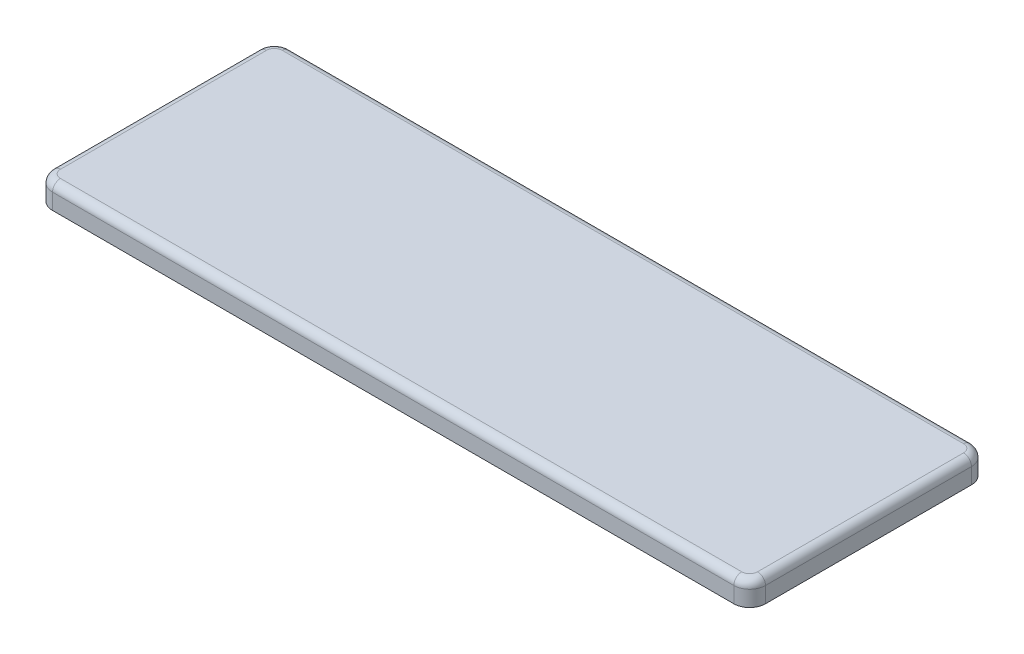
ISO-10303-21;
HEADER;
FILE_DESCRIPTION(('STEP AP214'),'2;1');
FILE_NAME('part.step','',(''),(''),'','','');
FILE_SCHEMA(('AUTOMOTIVE_DESIGN { 1 0 10303 214 1 1 1 1 }'));
ENDSEC;
DATA;
#1=APPLICATION_CONTEXT('core data for automotive mechanical design processes');
#2=APPLICATION_PROTOCOL_DEFINITION('international standard','automotive_design',2000,#1);
#3=PRODUCT_CONTEXT('',#1,'mechanical');
#4=PRODUCT('Part','Part','',(#3));
#5=PRODUCT_RELATED_PRODUCT_CATEGORY('part','',(#4));
#6=PRODUCT_DEFINITION_FORMATION('','',#4);
#7=PRODUCT_DEFINITION_CONTEXT('part definition',#1,'design');
#8=PRODUCT_DEFINITION('design','',#6,#7);
#9=PRODUCT_DEFINITION_SHAPE('','',#8);
#10=(LENGTH_UNIT() NAMED_UNIT(*) SI_UNIT(.MILLI.,.METRE.));
#11=(NAMED_UNIT(*) PLANE_ANGLE_UNIT() SI_UNIT($,.RADIAN.));
#12=(NAMED_UNIT(*) SI_UNIT($,.STERADIAN.) SOLID_ANGLE_UNIT());
#13=UNCERTAINTY_MEASURE_WITH_UNIT(LENGTH_MEASURE(1.E-05),#10,'distance_accuracy_value','');
#14=(GEOMETRIC_REPRESENTATION_CONTEXT(3) GLOBAL_UNCERTAINTY_ASSIGNED_CONTEXT((#13)) GLOBAL_UNIT_ASSIGNED_CONTEXT((#10,
#11,#12)) REPRESENTATION_CONTEXT('',''));
#15=CARTESIAN_POINT('',(0.,0.,0.));
#16=DIRECTION('',(0.,0.,1.));
#17=DIRECTION('',(1.,0.,0.));
#18=AXIS2_PLACEMENT_3D('',#15,#16,#17);
#19=CARTESIAN_POINT('',(-43.,-0.5,13.));
#20=DIRECTION('',(0.,-1.,0.));
#21=DIRECTION('',(0.,0.,-1.));
#22=AXIS2_PLACEMENT_3D('',#19,#20,#21);
#23=PLANE('',#22);
#24=DIRECTION('',(1.,0.,0.));
#25=VECTOR('',#24,1.);
#26=CARTESIAN_POINT('',(28.35,-0.5,-2.45));
#27=LINE('',#26,#25);
#28=CARTESIAN_POINT('',(28.35,-0.5,-2.45));
#29=VERTEX_POINT('',#28);
#30=CARTESIAN_POINT('',(31.65,-0.5,-2.45));
#31=VERTEX_POINT('',#30);
#32=EDGE_CURVE('E318',#29,#31,#27,.T.);
#33=ORIENTED_EDGE('',*,*,#32,.F.);
#34=DIRECTION('',(0.,0.,-1.));
#35=VECTOR('',#34,1.);
#36=CARTESIAN_POINT('',(28.35,-0.5,-2.45));
#37=LINE('',#36,#35);
#38=CARTESIAN_POINT('',(28.35,-0.5,2.45));
#39=VERTEX_POINT('',#38);
#40=EDGE_CURVE('E292',#39,#29,#37,.T.);
#41=ORIENTED_EDGE('',*,*,#40,.F.);
#42=DIRECTION('',(-1.,0.,0.));
#43=VECTOR('',#42,1.);
#44=CARTESIAN_POINT('',(28.35,-0.5,2.45));
#45=LINE('',#44,#43);
#46=CARTESIAN_POINT('',(31.65,-0.5,2.45));
#47=VERTEX_POINT('',#46);
#48=EDGE_CURVE('E324',#47,#39,#45,.T.);
#49=ORIENTED_EDGE('',*,*,#48,.F.);
#50=DIRECTION('',(0.,0.,1.));
#51=VECTOR('',#50,1.);
#52=CARTESIAN_POINT('',(31.65,-0.5,-2.45));
#53=LINE('',#52,#51);
#54=EDGE_CURVE('E321',#31,#47,#53,.T.);
#55=ORIENTED_EDGE('',*,*,#54,.F.);
#56=EDGE_LOOP('',(#33,#41,#49,#55));
#57=FACE_BOUND('',#56,.T.);
#58=CARTESIAN_POINT('',(-43.,-0.5,13.));
#59=DIRECTION('',(0.,-1.,0.));
#60=DIRECTION('',(0.,0.,-1.));
#61=AXIS2_PLACEMENT_3D('',#58,#59,#60);
#62=CIRCLE('',#61,0.200000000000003);
#63=CARTESIAN_POINT('',(-43.,-0.5,13.2));
#64=VERTEX_POINT('',#63);
#65=CARTESIAN_POINT('',(-43.2,-0.5,13.));
#66=VERTEX_POINT('',#65);
#67=EDGE_CURVE('E356',#64,#66,#62,.T.);
#68=ORIENTED_EDGE('',*,*,#67,.T.);
#69=DIRECTION('',(0.,0.,-1.));
#70=VECTOR('',#69,1.);
#71=CARTESIAN_POINT('',(-43.2,-0.5,13.));
#72=LINE('',#71,#70);
#73=CARTESIAN_POINT('',(-43.2,-0.5,-13.));
#74=VERTEX_POINT('',#73);
#75=EDGE_CURVE('E359',#66,#74,#72,.T.);
#76=ORIENTED_EDGE('',*,*,#75,.T.);
#77=CARTESIAN_POINT('',(-43.,-0.5,-13.));
#78=DIRECTION('',(0.,-1.,0.));
#79=DIRECTION('',(0.,0.,-1.));
#80=AXIS2_PLACEMENT_3D('',#77,#78,#79);
#81=CIRCLE('',#80,0.2);
#82=CARTESIAN_POINT('',(-43.,-0.5,-13.2));
#83=VERTEX_POINT('',#82);
#84=EDGE_CURVE('E363',#74,#83,#81,.T.);
#85=ORIENTED_EDGE('',*,*,#84,.T.);
#86=DIRECTION('',(1.,0.,0.));
#87=VECTOR('',#86,1.);
#88=CARTESIAN_POINT('',(-43.,-0.5,-13.2));
#89=LINE('',#88,#87);
#90=CARTESIAN_POINT('',(43.,-0.5,-13.2));
#91=VERTEX_POINT('',#90);
#92=EDGE_CURVE('E366',#83,#91,#89,.T.);
#93=ORIENTED_EDGE('',*,*,#92,.T.);
#94=CARTESIAN_POINT('',(43.,-0.5,-13.));
#95=DIRECTION('',(0.,-1.,0.));
#96=DIRECTION('',(0.,0.,-1.));
#97=AXIS2_PLACEMENT_3D('',#94,#95,#96);
#98=CIRCLE('',#97,0.199999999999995);
#99=CARTESIAN_POINT('',(43.2,-0.5,-13.));
#100=VERTEX_POINT('',#99);
#101=EDGE_CURVE('E369',#91,#100,#98,.T.);
#102=ORIENTED_EDGE('',*,*,#101,.T.);
#103=DIRECTION('',(0.,0.,1.));
#104=VECTOR('',#103,1.);
#105=CARTESIAN_POINT('',(43.2,-0.5,13.));
#106=LINE('',#105,#104);
#107=CARTESIAN_POINT('',(43.2,-0.5,13.));
#108=VERTEX_POINT('',#107);
#109=EDGE_CURVE('E372',#100,#108,#106,.T.);
#110=ORIENTED_EDGE('',*,*,#109,.T.);
#111=CARTESIAN_POINT('',(43.,-0.5,13.));
#112=DIRECTION('',(0.,-1.,0.));
#113=DIRECTION('',(0.,0.,-1.));
#114=AXIS2_PLACEMENT_3D('',#111,#112,#113);
#115=CIRCLE('',#114,0.200000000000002);
#116=CARTESIAN_POINT('',(43.,-0.5,13.2));
#117=VERTEX_POINT('',#116);
#118=EDGE_CURVE('E375',#108,#117,#115,.T.);
#119=ORIENTED_EDGE('',*,*,#118,.T.);
#120=DIRECTION('',(-1.,0.,0.));
#121=VECTOR('',#120,1.);
#122=CARTESIAN_POINT('',(-43.,-0.5,13.2));
#123=LINE('',#122,#121);
#124=EDGE_CURVE('E378',#117,#64,#123,.T.);
#125=ORIENTED_EDGE('',*,*,#124,.T.);
#126=EDGE_LOOP('',(#68,#76,#85,#93,#102,#110,#119,#125));
#127=FACE_BOUND('',#126,.T.);
#128=DIRECTION('',(1.,0.,0.));
#129=VECTOR('',#128,1.);
#130=CARTESIAN_POINT('',(-31.65,-0.5,-2.45));
#131=LINE('',#130,#129);
#132=CARTESIAN_POINT('',(-31.65,-0.5,-2.45));
#133=VERTEX_POINT('',#132);
#134=CARTESIAN_POINT('',(-28.35,-0.5,-2.45));
#135=VERTEX_POINT('',#134);
#136=EDGE_CURVE('E338',#133,#135,#131,.T.);
#137=ORIENTED_EDGE('',*,*,#136,.F.);
#138=DIRECTION('',(0.,0.,-1.));
#139=VECTOR('',#138,1.);
#140=CARTESIAN_POINT('',(-31.65,-0.5,2.45));
#141=LINE('',#140,#139);
#142=CARTESIAN_POINT('',(-31.65,-0.5,2.45));
#143=VERTEX_POINT('',#142);
#144=EDGE_CURVE('E330',#143,#133,#141,.T.);
#145=ORIENTED_EDGE('',*,*,#144,.F.);
#146=DIRECTION('',(-1.,0.,0.));
#147=VECTOR('',#146,1.);
#148=CARTESIAN_POINT('',(-31.65,-0.5,2.45));
#149=LINE('',#148,#147);
#150=CARTESIAN_POINT('',(-28.35,-0.5,2.45));
#151=VERTEX_POINT('',#150);
#152=EDGE_CURVE('E344',#151,#143,#149,.T.);
#153=ORIENTED_EDGE('',*,*,#152,.F.);
#154=DIRECTION('',(0.,0.,1.));
#155=VECTOR('',#154,1.);
#156=CARTESIAN_POINT('',(-28.35,-0.5,2.45));
#157=LINE('',#156,#155);
#158=EDGE_CURVE('E341',#135,#151,#157,.T.);
#159=ORIENTED_EDGE('',*,*,#158,.F.);
#160=EDGE_LOOP('',(#137,#145,#153,#159));
#161=FACE_BOUND('',#160,.T.);
#162=DIRECTION('',(1.,0.,0.));
#163=VECTOR('',#162,1.);
#164=CARTESIAN_POINT('',(-1.65,-0.5,-2.45));
#165=LINE('',#164,#163);
#166=CARTESIAN_POINT('',(-1.65,-0.5,-2.45));
#167=VERTEX_POINT('',#166);
#168=CARTESIAN_POINT('',(1.65,-0.5,-2.45));
#169=VERTEX_POINT('',#168);
#170=EDGE_CURVE('E286',#167,#169,#165,.T.);
#171=ORIENTED_EDGE('',*,*,#170,.F.);
#172=DIRECTION('',(0.,0.,-1.));
#173=VECTOR('',#172,1.);
#174=CARTESIAN_POINT('',(-1.65,-0.5,2.45));
#175=LINE('',#174,#173);
#176=CARTESIAN_POINT('',(-1.65,-0.5,2.45));
#177=VERTEX_POINT('',#176);
#178=EDGE_CURVE('E296',#177,#167,#175,.T.);
#179=ORIENTED_EDGE('',*,*,#178,.F.);
#180=DIRECTION('',(-1.,0.,0.));
#181=VECTOR('',#180,1.);
#182=CARTESIAN_POINT('',(-1.65,-0.5,2.45));
#183=LINE('',#182,#181);
#184=CARTESIAN_POINT('',(1.65,-0.5,2.45));
#185=VERTEX_POINT('',#184);
#186=EDGE_CURVE('E308',#185,#177,#183,.T.);
#187=ORIENTED_EDGE('',*,*,#186,.F.);
#188=DIRECTION('',(0.,0.,1.));
#189=VECTOR('',#188,1.);
#190=CARTESIAN_POINT('',(1.65,-0.5,2.45));
#191=LINE('',#190,#189);
#192=EDGE_CURVE('E306',#169,#185,#191,.T.);
#193=ORIENTED_EDGE('',*,*,#192,.F.);
#194=EDGE_LOOP('',(#171,#179,#187,#193));
#195=FACE_BOUND('',#194,.T.);
#196=ADVANCED_FACE('F35',(#57,#127,#161,#195),#23,.T.);
#197=CARTESIAN_POINT('',(-43.,1.5,-13.));
#198=DIRECTION('',(0.,-1.,0.));
#199=DIRECTION('',(0.,0.,-1.));
#200=AXIS2_PLACEMENT_3D('',#197,#198,#199);
#201=CYLINDRICAL_SURFACE('',#200,2.);
#202=DIRECTION('',(0.,-1.,0.));
#203=VECTOR('',#202,1.);
#204=CARTESIAN_POINT('',(-45.,1.5,-13.));
#205=LINE('',#204,#203);
#206=CARTESIAN_POINT('',(-45.,0.5,-13.));
#207=VERTEX_POINT('',#206);
#208=CARTESIAN_POINT('',(-45.,-1.5,-13.));
#209=VERTEX_POINT('',#208);
#210=EDGE_CURVE('E459',#207,#209,#205,.T.);
#211=ORIENTED_EDGE('',*,*,#210,.F.);
#212=CARTESIAN_POINT('',(-43.,0.5,-13.));
#213=DIRECTION('',(0.,1.,0.));
#214=DIRECTION('',(0.,0.,1.));
#215=AXIS2_PLACEMENT_3D('',#212,#213,#214);
#216=CIRCLE('',#215,2.);
#217=CARTESIAN_POINT('',(-43.,0.5,-15.));
#218=VERTEX_POINT('',#217);
#219=EDGE_CURVE('E483',#207,#218,#216,.F.);
#220=ORIENTED_EDGE('',*,*,#219,.T.);
#221=DIRECTION('',(0.,-1.,0.));
#222=VECTOR('',#221,1.);
#223=CARTESIAN_POINT('',(-43.,1.5,-15.));
#224=LINE('',#223,#222);
#225=CARTESIAN_POINT('',(-43.,-1.5,-15.));
#226=VERTEX_POINT('',#225);
#227=EDGE_CURVE('E445',#218,#226,#224,.T.);
#228=ORIENTED_EDGE('',*,*,#227,.T.);
#229=CARTESIAN_POINT('',(-43.,-1.5,-13.));
#230=DIRECTION('',(0.,1.,0.));
#231=DIRECTION('',(0.,0.,1.));
#232=AXIS2_PLACEMENT_3D('',#229,#230,#231);
#233=CIRCLE('',#232,2.);
#234=EDGE_CURVE('E420',#226,#209,#233,.T.);
#235=ORIENTED_EDGE('',*,*,#234,.T.);
#236=EDGE_LOOP('',(#211,#220,#228,#235));
#237=FACE_BOUND('',#236,.T.);
#238=ADVANCED_FACE('F630',(#237),#201,.T.);
#239=CARTESIAN_POINT('',(-45.,1.5,13.));
#240=DIRECTION('',(1.,0.,0.));
#241=DIRECTION('',(0.,0.,-1.));
#242=AXIS2_PLACEMENT_3D('',#239,#240,#241);
#243=PLANE('',#242);
#244=DIRECTION('',(0.,-1.,0.));
#245=VECTOR('',#244,1.);
#246=CARTESIAN_POINT('',(-45.,1.5,13.));
#247=LINE('',#246,#245);
#248=CARTESIAN_POINT('',(-45.,0.5,13.));
#249=VERTEX_POINT('',#248);
#250=CARTESIAN_POINT('',(-45.,-1.5,13.));
#251=VERTEX_POINT('',#250);
#252=EDGE_CURVE('E457',#249,#251,#247,.T.);
#253=ORIENTED_EDGE('',*,*,#252,.F.);
#254=DIRECTION('',(0.,0.,1.));
#255=VECTOR('',#254,1.);
#256=CARTESIAN_POINT('',(-45.,0.5,-13.));
#257=LINE('',#256,#255);
#258=EDGE_CURVE('E481',#249,#207,#257,.F.);
#259=ORIENTED_EDGE('',*,*,#258,.T.);
#260=ORIENTED_EDGE('',*,*,#210,.T.);
#261=DIRECTION('',(0.,0.,1.));
#262=VECTOR('',#261,1.);
#263=CARTESIAN_POINT('',(-45.,-1.5,13.));
#264=LINE('',#263,#262);
#265=EDGE_CURVE('E423',#209,#251,#264,.T.);
#266=ORIENTED_EDGE('',*,*,#265,.T.);
#267=EDGE_LOOP('',(#253,#259,#260,#266));
#268=FACE_BOUND('',#267,.T.);
#269=ADVANCED_FACE('F636',(#268),#243,.F.);
#270=CARTESIAN_POINT('',(-43.,1.5,13.));
#271=DIRECTION('',(0.,-1.,0.));
#272=DIRECTION('',(0.,0.,-1.));
#273=AXIS2_PLACEMENT_3D('',#270,#271,#272);
#274=CYLINDRICAL_SURFACE('',#273,2.);
#275=DIRECTION('',(0.,-1.,0.));
#276=VECTOR('',#275,1.);
#277=CARTESIAN_POINT('',(-43.,1.5,15.));
#278=LINE('',#277,#276);
#279=CARTESIAN_POINT('',(-43.,0.5,15.));
#280=VERTEX_POINT('',#279);
#281=CARTESIAN_POINT('',(-43.,-1.5,15.));
#282=VERTEX_POINT('',#281);
#283=EDGE_CURVE('E455',#280,#282,#278,.T.);
#284=ORIENTED_EDGE('',*,*,#283,.F.);
#285=CARTESIAN_POINT('',(-43.,0.5,13.));
#286=DIRECTION('',(0.,1.,0.));
#287=DIRECTION('',(0.,0.,1.));
#288=AXIS2_PLACEMENT_3D('',#285,#286,#287);
#289=CIRCLE('',#288,2.);
#290=EDGE_CURVE('E478',#280,#249,#289,.F.);
#291=ORIENTED_EDGE('',*,*,#290,.T.);
#292=ORIENTED_EDGE('',*,*,#252,.T.);
#293=CARTESIAN_POINT('',(-43.,-1.5,13.));
#294=DIRECTION('',(0.,1.,0.));
#295=DIRECTION('',(0.,0.,1.));
#296=AXIS2_PLACEMENT_3D('',#293,#294,#295);
#297=CIRCLE('',#296,2.);
#298=EDGE_CURVE('E427',#251,#282,#297,.T.);
#299=ORIENTED_EDGE('',*,*,#298,.T.);
#300=EDGE_LOOP('',(#284,#291,#292,#299));
#301=FACE_BOUND('',#300,.T.);
#302=ADVANCED_FACE('F706',(#301),#274,.T.);
#303=CARTESIAN_POINT('',(-43.,1.5,15.));
#304=DIRECTION('',(0.,0.,-1.));
#305=DIRECTION('',(-1.,0.,0.));
#306=AXIS2_PLACEMENT_3D('',#303,#304,#305);
#307=PLANE('',#306);
#308=DIRECTION('',(0.,-1.,0.));
#309=VECTOR('',#308,1.);
#310=CARTESIAN_POINT('',(43.,1.5,15.));
#311=LINE('',#310,#309);
#312=CARTESIAN_POINT('',(43.,0.5,15.));
#313=VERTEX_POINT('',#312);
#314=CARTESIAN_POINT('',(43.,-1.5,15.));
#315=VERTEX_POINT('',#314);
#316=EDGE_CURVE('E453',#313,#315,#311,.T.);
#317=ORIENTED_EDGE('',*,*,#316,.F.);
#318=DIRECTION('',(1.,0.,0.));
#319=VECTOR('',#318,1.);
#320=CARTESIAN_POINT('',(-43.,0.5,15.));
#321=LINE('',#320,#319);
#322=EDGE_CURVE('E493',#313,#280,#321,.F.);
#323=ORIENTED_EDGE('',*,*,#322,.T.);
#324=ORIENTED_EDGE('',*,*,#283,.T.);
#325=DIRECTION('',(1.,0.,0.));
#326=VECTOR('',#325,1.);
#327=CARTESIAN_POINT('',(-43.,-1.5,15.));
#328=LINE('',#327,#326);
#329=EDGE_CURVE('E430',#282,#315,#328,.T.);
#330=ORIENTED_EDGE('',*,*,#329,.T.);
#331=EDGE_LOOP('',(#317,#323,#324,#330));
#332=FACE_BOUND('',#331,.T.);
#333=ADVANCED_FACE('F702',(#332),#307,.F.);
#334=CARTESIAN_POINT('',(43.,1.5,13.));
#335=DIRECTION('',(0.,-1.,0.));
#336=DIRECTION('',(0.,0.,-1.));
#337=AXIS2_PLACEMENT_3D('',#334,#335,#336);
#338=CYLINDRICAL_SURFACE('',#337,2.);
#339=DIRECTION('',(0.,-1.,0.));
#340=VECTOR('',#339,1.);
#341=CARTESIAN_POINT('',(45.,1.5,13.));
#342=LINE('',#341,#340);
#343=CARTESIAN_POINT('',(45.,0.5,13.));
#344=VERTEX_POINT('',#343);
#345=CARTESIAN_POINT('',(45.,-1.5,13.));
#346=VERTEX_POINT('',#345);
#347=EDGE_CURVE('E451',#344,#346,#342,.T.);
#348=ORIENTED_EDGE('',*,*,#347,.F.);
#349=CARTESIAN_POINT('',(43.,0.5,13.));
#350=DIRECTION('',(0.,1.,0.));
#351=DIRECTION('',(0.,0.,1.));
#352=AXIS2_PLACEMENT_3D('',#349,#350,#351);
#353=CIRCLE('',#352,2.);
#354=EDGE_CURVE('E491',#344,#313,#353,.F.);
#355=ORIENTED_EDGE('',*,*,#354,.T.);
#356=ORIENTED_EDGE('',*,*,#316,.T.);
#357=CARTESIAN_POINT('',(43.,-1.5,13.));
#358=DIRECTION('',(0.,1.,0.));
#359=DIRECTION('',(0.,0.,1.));
#360=AXIS2_PLACEMENT_3D('',#357,#358,#359);
#361=CIRCLE('',#360,2.);
#362=EDGE_CURVE('E433',#315,#346,#361,.T.);
#363=ORIENTED_EDGE('',*,*,#362,.T.);
#364=EDGE_LOOP('',(#348,#355,#356,#363));
#365=FACE_BOUND('',#364,.T.);
#366=ADVANCED_FACE('F698',(#365),#338,.T.);
#367=CARTESIAN_POINT('',(45.,1.5,13.));
#368=DIRECTION('',(-1.,0.,0.));
#369=DIRECTION('',(0.,0.,1.));
#370=AXIS2_PLACEMENT_3D('',#367,#368,#369);
#371=PLANE('',#370);
#372=DIRECTION('',(0.,-1.,0.));
#373=VECTOR('',#372,1.);
#374=CARTESIAN_POINT('',(45.,1.5,-13.));
#375=LINE('',#374,#373);
#376=CARTESIAN_POINT('',(45.,0.5,-13.));
#377=VERTEX_POINT('',#376);
#378=CARTESIAN_POINT('',(45.,-1.5,-13.));
#379=VERTEX_POINT('',#378);
#380=EDGE_CURVE('E449',#377,#379,#375,.T.);
#381=ORIENTED_EDGE('',*,*,#380,.F.);
#382=DIRECTION('',(0.,0.,-1.));
#383=VECTOR('',#382,1.);
#384=CARTESIAN_POINT('',(45.,0.5,13.));
#385=LINE('',#384,#383);
#386=EDGE_CURVE('E489',#377,#344,#385,.F.);
#387=ORIENTED_EDGE('',*,*,#386,.T.);
#388=ORIENTED_EDGE('',*,*,#347,.T.);
#389=DIRECTION('',(0.,0.,-1.));
#390=VECTOR('',#389,1.);
#391=CARTESIAN_POINT('',(45.,-1.5,13.));
#392=LINE('',#391,#390);
#393=EDGE_CURVE('E436',#346,#379,#392,.T.);
#394=ORIENTED_EDGE('',*,*,#393,.T.);
#395=EDGE_LOOP('',(#381,#387,#388,#394));
#396=FACE_BOUND('',#395,.T.);
#397=ADVANCED_FACE('F694',(#396),#371,.F.);
#398=CARTESIAN_POINT('',(43.,1.5,-13.));
#399=DIRECTION('',(0.,-1.,0.));
#400=DIRECTION('',(0.,0.,-1.));
#401=AXIS2_PLACEMENT_3D('',#398,#399,#400);
#402=CYLINDRICAL_SURFACE('',#401,2.);
#403=DIRECTION('',(0.,-1.,0.));
#404=VECTOR('',#403,1.);
#405=CARTESIAN_POINT('',(43.,1.5,-15.));
#406=LINE('',#405,#404);
#407=CARTESIAN_POINT('',(43.,0.5,-15.));
#408=VERTEX_POINT('',#407);
#409=CARTESIAN_POINT('',(43.,-1.5,-15.));
#410=VERTEX_POINT('',#409);
#411=EDGE_CURVE('E447',#408,#410,#406,.T.);
#412=ORIENTED_EDGE('',*,*,#411,.F.);
#413=CARTESIAN_POINT('',(43.,0.5,-13.));
#414=DIRECTION('',(0.,1.,0.));
#415=DIRECTION('',(0.,0.,1.));
#416=AXIS2_PLACEMENT_3D('',#413,#414,#415);
#417=CIRCLE('',#416,2.);
#418=EDGE_CURVE('E487',#408,#377,#417,.F.);
#419=ORIENTED_EDGE('',*,*,#418,.T.);
#420=ORIENTED_EDGE('',*,*,#380,.T.);
#421=CARTESIAN_POINT('',(43.,-1.5,-13.));
#422=DIRECTION('',(0.,1.,0.));
#423=DIRECTION('',(0.,0.,1.));
#424=AXIS2_PLACEMENT_3D('',#421,#422,#423);
#425=CIRCLE('',#424,2.);
#426=EDGE_CURVE('E439',#379,#410,#425,.T.);
#427=ORIENTED_EDGE('',*,*,#426,.T.);
#428=EDGE_LOOP('',(#412,#419,#420,#427));
#429=FACE_BOUND('',#428,.T.);
#430=ADVANCED_FACE('F690',(#429),#402,.T.);
#431=CARTESIAN_POINT('',(-43.,1.5,-15.));
#432=DIRECTION('',(0.,0.,1.));
#433=DIRECTION('',(1.,0.,0.));
#434=AXIS2_PLACEMENT_3D('',#431,#432,#433);
#435=PLANE('',#434);
#436=ORIENTED_EDGE('',*,*,#227,.F.);
#437=DIRECTION('',(-1.,0.,0.));
#438=VECTOR('',#437,1.);
#439=CARTESIAN_POINT('',(43.,0.5,-15.));
#440=LINE('',#439,#438);
#441=EDGE_CURVE('E485',#218,#408,#440,.F.);
#442=ORIENTED_EDGE('',*,*,#441,.T.);
#443=ORIENTED_EDGE('',*,*,#411,.T.);
#444=DIRECTION('',(-1.,0.,0.));
#445=VECTOR('',#444,1.);
#446=CARTESIAN_POINT('',(-43.,-1.5,-15.));
#447=LINE('',#446,#445);
#448=EDGE_CURVE('E442',#410,#226,#447,.T.);
#449=ORIENTED_EDGE('',*,*,#448,.T.);
#450=EDGE_LOOP('',(#436,#442,#443,#449));
#451=FACE_BOUND('',#450,.T.);
#452=ADVANCED_FACE('F682',(#451),#435,.F.);
#453=CARTESIAN_POINT('',(-43.,1.5,-13.));
#454=DIRECTION('',(0.,1.,0.));
#455=DIRECTION('',(0.,0.,1.));
#456=AXIS2_PLACEMENT_3D('',#453,#454,#455);
#457=PLANE('',#456);
#458=DIRECTION('',(0.,0.,1.));
#459=VECTOR('',#458,1.);
#460=CARTESIAN_POINT('',(-44.,1.5,13.));
#461=LINE('',#460,#459);
#462=CARTESIAN_POINT('',(-44.,1.5,-13.));
#463=VERTEX_POINT('',#462);
#464=CARTESIAN_POINT('',(-44.,1.5,13.));
#465=VERTEX_POINT('',#464);
#466=EDGE_CURVE('E473',#463,#465,#461,.T.);
#467=ORIENTED_EDGE('',*,*,#466,.T.);
#468=CARTESIAN_POINT('',(-43.,1.5,13.));
#469=DIRECTION('',(0.,1.,0.));
#470=DIRECTION('',(0.,0.,1.));
#471=AXIS2_PLACEMENT_3D('',#468,#469,#470);
#472=CIRCLE('',#471,1.);
#473=CARTESIAN_POINT('',(-43.,1.5,14.));
#474=VERTEX_POINT('',#473);
#475=EDGE_CURVE('E475',#465,#474,#472,.T.);
#476=ORIENTED_EDGE('',*,*,#475,.T.);
#477=DIRECTION('',(1.,0.,0.));
#478=VECTOR('',#477,1.);
#479=CARTESIAN_POINT('',(43.,1.5,14.));
#480=LINE('',#479,#478);
#481=CARTESIAN_POINT('',(43.,1.5,14.));
#482=VERTEX_POINT('',#481);
#483=EDGE_CURVE('E461',#474,#482,#480,.T.);
#484=ORIENTED_EDGE('',*,*,#483,.T.);
#485=CARTESIAN_POINT('',(43.,1.5,13.));
#486=DIRECTION('',(0.,1.,0.));
#487=DIRECTION('',(0.,0.,1.));
#488=AXIS2_PLACEMENT_3D('',#485,#486,#487);
#489=CIRCLE('',#488,1.);
#490=CARTESIAN_POINT('',(44.,1.5,13.));
#491=VERTEX_POINT('',#490);
#492=EDGE_CURVE('E463',#482,#491,#489,.T.);
#493=ORIENTED_EDGE('',*,*,#492,.T.);
#494=DIRECTION('',(0.,0.,-1.));
#495=VECTOR('',#494,1.);
#496=CARTESIAN_POINT('',(44.,1.5,-13.));
#497=LINE('',#496,#495);
#498=CARTESIAN_POINT('',(44.,1.5,-13.));
#499=VERTEX_POINT('',#498);
#500=EDGE_CURVE('E465',#491,#499,#497,.T.);
#501=ORIENTED_EDGE('',*,*,#500,.T.);
#502=CARTESIAN_POINT('',(43.,1.5,-13.));
#503=DIRECTION('',(0.,1.,0.));
#504=DIRECTION('',(0.,0.,1.));
#505=AXIS2_PLACEMENT_3D('',#502,#503,#504);
#506=CIRCLE('',#505,1.);
#507=CARTESIAN_POINT('',(43.,1.5,-14.));
#508=VERTEX_POINT('',#507);
#509=EDGE_CURVE('E467',#499,#508,#506,.T.);
#510=ORIENTED_EDGE('',*,*,#509,.T.);
#511=DIRECTION('',(-1.,0.,0.));
#512=VECTOR('',#511,1.);
#513=CARTESIAN_POINT('',(-43.,1.5,-14.));
#514=LINE('',#513,#512);
#515=CARTESIAN_POINT('',(-43.,1.5,-14.));
#516=VERTEX_POINT('',#515);
#517=EDGE_CURVE('E469',#508,#516,#514,.T.);
#518=ORIENTED_EDGE('',*,*,#517,.T.);
#519=CARTESIAN_POINT('',(-43.,1.5,-13.));
#520=DIRECTION('',(0.,1.,0.));
#521=DIRECTION('',(0.,0.,1.));
#522=AXIS2_PLACEMENT_3D('',#519,#520,#521);
#523=CIRCLE('',#522,1.);
#524=EDGE_CURVE('E471',#516,#463,#523,.T.);
#525=ORIENTED_EDGE('',*,*,#524,.T.);
#526=EDGE_LOOP('',(#467,#476,#484,#493,#501,#510,#518,#525));
#527=FACE_BOUND('',#526,.T.);
#528=ADVANCED_FACE('F678',(#527),#457,.T.);
#529=CARTESIAN_POINT('',(-43.,-1.5,-13.));
#530=DIRECTION('',(0.,1.,0.));
#531=DIRECTION('',(0.,0.,1.));
#532=AXIS2_PLACEMENT_3D('',#529,#530,#531);
#533=PLANE('',#532);
#534=DIRECTION('',(0.,0.,-1.));
#535=VECTOR('',#534,1.);
#536=CARTESIAN_POINT('',(-43.2,-1.5,13.));
#537=LINE('',#536,#535);
#538=CARTESIAN_POINT('',(-43.2,-1.5,13.));
#539=VERTEX_POINT('',#538);
#540=CARTESIAN_POINT('',(-43.2,-1.5,-13.));
#541=VERTEX_POINT('',#540);
#542=EDGE_CURVE('E383',#539,#541,#537,.T.);
#543=ORIENTED_EDGE('',*,*,#542,.F.);
#544=CARTESIAN_POINT('',(-43.,-1.5,13.));
#545=DIRECTION('',(0.,-1.,0.));
#546=DIRECTION('',(0.,0.,-1.));
#547=AXIS2_PLACEMENT_3D('',#544,#545,#546);
#548=CIRCLE('',#547,0.200000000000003);
#549=CARTESIAN_POINT('',(-43.,-1.5,13.2));
#550=VERTEX_POINT('',#549);
#551=EDGE_CURVE('E350',#550,#539,#548,.T.);
#552=ORIENTED_EDGE('',*,*,#551,.F.);
#553=DIRECTION('',(-1.,0.,0.));
#554=VECTOR('',#553,1.);
#555=CARTESIAN_POINT('',(-43.,-1.5,13.2));
#556=LINE('',#555,#554);
#557=CARTESIAN_POINT('',(43.,-1.5,13.2));
#558=VERTEX_POINT('',#557);
#559=EDGE_CURVE('E360',#558,#550,#556,.T.);
#560=ORIENTED_EDGE('',*,*,#559,.F.);
#561=CARTESIAN_POINT('',(43.,-1.5,13.));
#562=DIRECTION('',(0.,-1.,0.));
#563=DIRECTION('',(0.,0.,-1.));
#564=AXIS2_PLACEMENT_3D('',#561,#562,#563);
#565=CIRCLE('',#564,0.200000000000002);
#566=CARTESIAN_POINT('',(43.2,-1.5,13.));
#567=VERTEX_POINT('',#566);
#568=EDGE_CURVE('E398',#567,#558,#565,.T.);
#569=ORIENTED_EDGE('',*,*,#568,.F.);
#570=DIRECTION('',(0.,0.,1.));
#571=VECTOR('',#570,1.);
#572=CARTESIAN_POINT('',(43.2,-1.5,13.));
#573=LINE('',#572,#571);
#574=CARTESIAN_POINT('',(43.2,-1.5,-13.));
#575=VERTEX_POINT('',#574);
#576=EDGE_CURVE('E395',#575,#567,#573,.T.);
#577=ORIENTED_EDGE('',*,*,#576,.F.);
#578=CARTESIAN_POINT('',(43.,-1.5,-13.));
#579=DIRECTION('',(0.,-1.,0.));
#580=DIRECTION('',(0.,0.,-1.));
#581=AXIS2_PLACEMENT_3D('',#578,#579,#580);
#582=CIRCLE('',#581,0.199999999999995);
#583=CARTESIAN_POINT('',(43.,-1.5,-13.2));
#584=VERTEX_POINT('',#583);
#585=EDGE_CURVE('E392',#584,#575,#582,.T.);
#586=ORIENTED_EDGE('',*,*,#585,.F.);
#587=DIRECTION('',(1.,0.,0.));
#588=VECTOR('',#587,1.);
#589=CARTESIAN_POINT('',(-43.,-1.5,-13.2));
#590=LINE('',#589,#588);
#591=CARTESIAN_POINT('',(-43.,-1.5,-13.2));
#592=VERTEX_POINT('',#591);
#593=EDGE_CURVE('E389',#592,#584,#590,.T.);
#594=ORIENTED_EDGE('',*,*,#593,.F.);
#595=CARTESIAN_POINT('',(-43.,-1.5,-13.));
#596=DIRECTION('',(0.,-1.,0.));
#597=DIRECTION('',(0.,0.,-1.));
#598=AXIS2_PLACEMENT_3D('',#595,#596,#597);
#599=CIRCLE('',#598,0.2);
#600=EDGE_CURVE('E386',#541,#592,#599,.T.);
#601=ORIENTED_EDGE('',*,*,#600,.F.);
#602=EDGE_LOOP('',(#543,#552,#560,#569,#577,#586,#594,#601));
#603=FACE_BOUND('',#602,.T.);
#604=ORIENTED_EDGE('',*,*,#234,.F.);
#605=ORIENTED_EDGE('',*,*,#448,.F.);
#606=ORIENTED_EDGE('',*,*,#426,.F.);
#607=ORIENTED_EDGE('',*,*,#393,.F.);
#608=ORIENTED_EDGE('',*,*,#362,.F.);
#609=ORIENTED_EDGE('',*,*,#329,.F.);
#610=ORIENTED_EDGE('',*,*,#298,.F.);
#611=ORIENTED_EDGE('',*,*,#265,.F.);
#612=EDGE_LOOP('',(#604,#605,#606,#607,#608,#609,#610,#611));
#613=FACE_BOUND('',#612,.T.);
#614=ADVANCED_FACE('F681',(#603,#613),#533,.F.);
#615=CARTESIAN_POINT('',(43.,0.5,-13.));
#616=DIRECTION('',(0.,1.,0.));
#617=DIRECTION('',(0.,0.,1.));
#618=AXIS2_PLACEMENT_3D('',#615,#616,#617);
#619=TOROIDAL_SURFACE('',#618,1.,1.);
#620=CARTESIAN_POINT('',(44.,0.5,-13.));
#621=DIRECTION('',(0.,0.,1.));
#622=DIRECTION('',(1.,0.,0.));
#623=AXIS2_PLACEMENT_3D('',#620,#621,#622);
#624=CIRCLE('',#623,1.);
#625=EDGE_CURVE('E511',#377,#499,#624,.T.);
#626=ORIENTED_EDGE('',*,*,#625,.F.);
#627=ORIENTED_EDGE('',*,*,#418,.F.);
#628=CARTESIAN_POINT('',(43.,0.5,-14.));
#629=DIRECTION('',(-1.,0.,0.));
#630=DIRECTION('',(0.,0.,1.));
#631=AXIS2_PLACEMENT_3D('',#628,#629,#630);
#632=CIRCLE('',#631,1.);
#633=EDGE_CURVE('E424',#508,#408,#632,.T.);
#634=ORIENTED_EDGE('',*,*,#633,.F.);
#635=ORIENTED_EDGE('',*,*,#509,.F.);
#636=EDGE_LOOP('',(#626,#627,#634,#635));
#637=FACE_BOUND('',#636,.T.);
#638=ADVANCED_FACE('F686',(#637),#619,.T.);
#639=CARTESIAN_POINT('',(-43.,0.5,-14.));
#640=DIRECTION('',(1.,0.,0.));
#641=DIRECTION('',(0.,0.,-1.));
#642=AXIS2_PLACEMENT_3D('',#639,#640,#641);
#643=CYLINDRICAL_SURFACE('',#642,1.);
#644=ORIENTED_EDGE('',*,*,#633,.T.);
#645=ORIENTED_EDGE('',*,*,#441,.F.);
#646=CARTESIAN_POINT('',(-43.,0.5,-14.));
#647=DIRECTION('',(-1.,0.,0.));
#648=DIRECTION('',(0.,0.,1.));
#649=AXIS2_PLACEMENT_3D('',#646,#647,#648);
#650=CIRCLE('',#649,1.);
#651=EDGE_CURVE('E508',#516,#218,#650,.T.);
#652=ORIENTED_EDGE('',*,*,#651,.F.);
#653=ORIENTED_EDGE('',*,*,#517,.F.);
#654=EDGE_LOOP('',(#644,#645,#652,#653));
#655=FACE_BOUND('',#654,.T.);
#656=ADVANCED_FACE('F736',(#655),#643,.T.);
#657=CARTESIAN_POINT('',(44.,0.5,-13.));
#658=DIRECTION('',(0.,0.,1.));
#659=DIRECTION('',(1.,0.,0.));
#660=AXIS2_PLACEMENT_3D('',#657,#658,#659);
#661=CYLINDRICAL_SURFACE('',#660,1.);
#662=ORIENTED_EDGE('',*,*,#625,.T.);
#663=ORIENTED_EDGE('',*,*,#500,.F.);
#664=CARTESIAN_POINT('',(44.,0.5,13.));
#665=DIRECTION('',(0.,0.,1.));
#666=DIRECTION('',(1.,0.,0.));
#667=AXIS2_PLACEMENT_3D('',#664,#665,#666);
#668=CIRCLE('',#667,1.);
#669=EDGE_CURVE('E505',#344,#491,#668,.T.);
#670=ORIENTED_EDGE('',*,*,#669,.F.);
#671=ORIENTED_EDGE('',*,*,#386,.F.);
#672=EDGE_LOOP('',(#662,#663,#670,#671));
#673=FACE_BOUND('',#672,.T.);
#674=ADVANCED_FACE('F732',(#673),#661,.T.);
#675=CARTESIAN_POINT('',(-43.,0.5,-13.));
#676=DIRECTION('',(0.,1.,0.));
#677=DIRECTION('',(0.,0.,1.));
#678=AXIS2_PLACEMENT_3D('',#675,#676,#677);
#679=TOROIDAL_SURFACE('',#678,1.,1.);
#680=ORIENTED_EDGE('',*,*,#651,.T.);
#681=ORIENTED_EDGE('',*,*,#219,.F.);
#682=CARTESIAN_POINT('',(-44.,0.5,-13.));
#683=DIRECTION('',(0.,0.,1.));
#684=DIRECTION('',(1.,0.,0.));
#685=AXIS2_PLACEMENT_3D('',#682,#683,#684);
#686=CIRCLE('',#685,1.);
#687=EDGE_CURVE('E502',#463,#207,#686,.T.);
#688=ORIENTED_EDGE('',*,*,#687,.F.);
#689=ORIENTED_EDGE('',*,*,#524,.F.);
#690=EDGE_LOOP('',(#680,#681,#688,#689));
#691=FACE_BOUND('',#690,.T.);
#692=ADVANCED_FACE('F728',(#691),#679,.T.);
#693=CARTESIAN_POINT('',(43.,0.5,13.));
#694=DIRECTION('',(0.,1.,0.));
#695=DIRECTION('',(0.,0.,1.));
#696=AXIS2_PLACEMENT_3D('',#693,#694,#695);
#697=TOROIDAL_SURFACE('',#696,1.,1.);
#698=ORIENTED_EDGE('',*,*,#669,.T.);
#699=ORIENTED_EDGE('',*,*,#492,.F.);
#700=CARTESIAN_POINT('',(43.,0.5,14.));
#701=DIRECTION('',(-1.,0.,0.));
#702=DIRECTION('',(0.,0.,1.));
#703=AXIS2_PLACEMENT_3D('',#700,#701,#702);
#704=CIRCLE('',#703,1.);
#705=EDGE_CURVE('E499',#313,#482,#704,.T.);
#706=ORIENTED_EDGE('',*,*,#705,.F.);
#707=ORIENTED_EDGE('',*,*,#354,.F.);
#708=EDGE_LOOP('',(#698,#699,#706,#707));
#709=FACE_BOUND('',#708,.T.);
#710=ADVANCED_FACE('F724',(#709),#697,.T.);
#711=CARTESIAN_POINT('',(-44.,0.5,-13.));
#712=DIRECTION('',(0.,0.,-1.));
#713=DIRECTION('',(-1.,0.,0.));
#714=AXIS2_PLACEMENT_3D('',#711,#712,#713);
#715=CYLINDRICAL_SURFACE('',#714,1.);
#716=ORIENTED_EDGE('',*,*,#687,.T.);
#717=ORIENTED_EDGE('',*,*,#258,.F.);
#718=CARTESIAN_POINT('',(-44.,0.5,13.));
#719=DIRECTION('',(0.,0.,1.));
#720=DIRECTION('',(1.,0.,0.));
#721=AXIS2_PLACEMENT_3D('',#718,#719,#720);
#722=CIRCLE('',#721,1.);
#723=EDGE_CURVE('E497',#465,#249,#722,.T.);
#724=ORIENTED_EDGE('',*,*,#723,.F.);
#725=ORIENTED_EDGE('',*,*,#466,.F.);
#726=EDGE_LOOP('',(#716,#717,#724,#725));
#727=FACE_BOUND('',#726,.T.);
#728=ADVANCED_FACE('F720',(#727),#715,.T.);
#729=CARTESIAN_POINT('',(-43.,0.5,14.));
#730=DIRECTION('',(-1.,0.,0.));
#731=DIRECTION('',(0.,0.,1.));
#732=AXIS2_PLACEMENT_3D('',#729,#730,#731);
#733=CYLINDRICAL_SURFACE('',#732,1.);
#734=ORIENTED_EDGE('',*,*,#705,.T.);
#735=ORIENTED_EDGE('',*,*,#483,.F.);
#736=CARTESIAN_POINT('',(-43.,0.5,14.));
#737=DIRECTION('',(-1.,0.,0.));
#738=DIRECTION('',(0.,0.,1.));
#739=AXIS2_PLACEMENT_3D('',#736,#737,#738);
#740=CIRCLE('',#739,1.);
#741=EDGE_CURVE('E405',#280,#474,#740,.T.);
#742=ORIENTED_EDGE('',*,*,#741,.F.);
#743=ORIENTED_EDGE('',*,*,#322,.F.);
#744=EDGE_LOOP('',(#734,#735,#742,#743));
#745=FACE_BOUND('',#744,.T.);
#746=ADVANCED_FACE('F716',(#745),#733,.T.);
#747=CARTESIAN_POINT('',(-43.,0.5,13.));
#748=DIRECTION('',(0.,1.,0.));
#749=DIRECTION('',(0.,0.,1.));
#750=AXIS2_PLACEMENT_3D('',#747,#748,#749);
#751=TOROIDAL_SURFACE('',#750,1.,1.);
#752=ORIENTED_EDGE('',*,*,#723,.T.);
#753=ORIENTED_EDGE('',*,*,#290,.F.);
#754=ORIENTED_EDGE('',*,*,#741,.T.);
#755=ORIENTED_EDGE('',*,*,#475,.F.);
#756=EDGE_LOOP('',(#752,#753,#754,#755));
#757=FACE_BOUND('',#756,.T.);
#758=ADVANCED_FACE('F676',(#757),#751,.T.);
#759=CARTESIAN_POINT('',(-43.,-0.5,13.));
#760=DIRECTION('',(0.,-1.,0.));
#761=DIRECTION('',(0.,0.,-1.));
#762=AXIS2_PLACEMENT_3D('',#759,#760,#761);
#763=CYLINDRICAL_SURFACE('',#762,0.200000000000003);
#764=ORIENTED_EDGE('',*,*,#551,.T.);
#765=DIRECTION('',(0.,-1.,0.));
#766=VECTOR('',#765,1.);
#767=CARTESIAN_POINT('',(-43.2,-0.5,13.));
#768=LINE('',#767,#766);
#769=EDGE_CURVE('E381',#66,#539,#768,.T.);
#770=ORIENTED_EDGE('',*,*,#769,.F.);
#771=ORIENTED_EDGE('',*,*,#67,.F.);
#772=DIRECTION('',(0.,-1.,0.));
#773=VECTOR('',#772,1.);
#774=CARTESIAN_POINT('',(-43.,-0.5,13.2));
#775=LINE('',#774,#773);
#776=EDGE_CURVE('E403',#64,#550,#775,.T.);
#777=ORIENTED_EDGE('',*,*,#776,.T.);
#778=EDGE_LOOP('',(#764,#770,#771,#777));
#779=FACE_BOUND('',#778,.T.);
#780=ADVANCED_FACE('F649',(#779),#763,.F.);
#781=CARTESIAN_POINT('',(-43.,-0.5,13.2));
#782=DIRECTION('',(0.,0.,1.));
#783=DIRECTION('',(1.,0.,0.));
#784=AXIS2_PLACEMENT_3D('',#781,#782,#783);
#785=PLANE('',#784);
#786=ORIENTED_EDGE('',*,*,#559,.T.);
#787=ORIENTED_EDGE('',*,*,#776,.F.);
#788=ORIENTED_EDGE('',*,*,#124,.F.);
#789=DIRECTION('',(0.,-1.,0.));
#790=VECTOR('',#789,1.);
#791=CARTESIAN_POINT('',(43.,-0.5,13.2));
#792=LINE('',#791,#790);
#793=EDGE_CURVE('E406',#117,#558,#792,.T.);
#794=ORIENTED_EDGE('',*,*,#793,.T.);
#795=EDGE_LOOP('',(#786,#787,#788,#794));
#796=FACE_BOUND('',#795,.T.);
#797=ADVANCED_FACE('F645',(#796),#785,.F.);
#798=CARTESIAN_POINT('',(43.,-0.5,13.));
#799=DIRECTION('',(0.,-1.,0.));
#800=DIRECTION('',(0.,0.,-1.));
#801=AXIS2_PLACEMENT_3D('',#798,#799,#800);
#802=CYLINDRICAL_SURFACE('',#801,0.200000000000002);
#803=ORIENTED_EDGE('',*,*,#568,.T.);
#804=ORIENTED_EDGE('',*,*,#793,.F.);
#805=ORIENTED_EDGE('',*,*,#118,.F.);
#806=DIRECTION('',(0.,-1.,0.));
#807=VECTOR('',#806,1.);
#808=CARTESIAN_POINT('',(43.2,-0.5,13.));
#809=LINE('',#808,#807);
#810=EDGE_CURVE('E408',#108,#567,#809,.T.);
#811=ORIENTED_EDGE('',*,*,#810,.T.);
#812=EDGE_LOOP('',(#803,#804,#805,#811));
#813=FACE_BOUND('',#812,.T.);
#814=ADVANCED_FACE('F648',(#813),#802,.F.);
#815=CARTESIAN_POINT('',(43.2,-0.5,13.));
#816=DIRECTION('',(1.,0.,0.));
#817=DIRECTION('',(0.,0.,-1.));
#818=AXIS2_PLACEMENT_3D('',#815,#816,#817);
#819=PLANE('',#818);
#820=ORIENTED_EDGE('',*,*,#576,.T.);
#821=ORIENTED_EDGE('',*,*,#810,.F.);
#822=ORIENTED_EDGE('',*,*,#109,.F.);
#823=DIRECTION('',(0.,-1.,0.));
#824=VECTOR('',#823,1.);
#825=CARTESIAN_POINT('',(43.2,-0.5,-13.));
#826=LINE('',#825,#824);
#827=EDGE_CURVE('E410',#100,#575,#826,.T.);
#828=ORIENTED_EDGE('',*,*,#827,.T.);
#829=EDGE_LOOP('',(#820,#821,#822,#828));
#830=FACE_BOUND('',#829,.T.);
#831=ADVANCED_FACE('F653',(#830),#819,.F.);
#832=CARTESIAN_POINT('',(43.,-0.5,-13.));
#833=DIRECTION('',(0.,-1.,0.));
#834=DIRECTION('',(0.,0.,-1.));
#835=AXIS2_PLACEMENT_3D('',#832,#833,#834);
#836=CYLINDRICAL_SURFACE('',#835,0.199999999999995);
#837=ORIENTED_EDGE('',*,*,#585,.T.);
#838=ORIENTED_EDGE('',*,*,#827,.F.);
#839=ORIENTED_EDGE('',*,*,#101,.F.);
#840=DIRECTION('',(0.,-1.,0.));
#841=VECTOR('',#840,1.);
#842=CARTESIAN_POINT('',(43.,-0.5,-13.2));
#843=LINE('',#842,#841);
#844=EDGE_CURVE('E412',#91,#584,#843,.T.);
#845=ORIENTED_EDGE('',*,*,#844,.T.);
#846=EDGE_LOOP('',(#837,#838,#839,#845));
#847=FACE_BOUND('',#846,.T.);
#848=ADVANCED_FACE('F657',(#847),#836,.F.);
#849=CARTESIAN_POINT('',(-43.,-0.5,-13.2));
#850=DIRECTION('',(0.,0.,-1.));
#851=DIRECTION('',(-1.,0.,0.));
#852=AXIS2_PLACEMENT_3D('',#849,#850,#851);
#853=PLANE('',#852);
#854=ORIENTED_EDGE('',*,*,#593,.T.);
#855=ORIENTED_EDGE('',*,*,#844,.F.);
#856=ORIENTED_EDGE('',*,*,#92,.F.);
#857=DIRECTION('',(0.,-1.,0.));
#858=VECTOR('',#857,1.);
#859=CARTESIAN_POINT('',(-43.,-0.5,-13.2));
#860=LINE('',#859,#858);
#861=EDGE_CURVE('E414',#83,#592,#860,.T.);
#862=ORIENTED_EDGE('',*,*,#861,.T.);
#863=EDGE_LOOP('',(#854,#855,#856,#862));
#864=FACE_BOUND('',#863,.T.);
#865=ADVANCED_FACE('F661',(#864),#853,.F.);
#866=CARTESIAN_POINT('',(-43.,-0.5,-13.));
#867=DIRECTION('',(0.,-1.,0.));
#868=DIRECTION('',(0.,0.,-1.));
#869=AXIS2_PLACEMENT_3D('',#866,#867,#868);
#870=CYLINDRICAL_SURFACE('',#869,0.2);
#871=ORIENTED_EDGE('',*,*,#600,.T.);
#872=ORIENTED_EDGE('',*,*,#861,.F.);
#873=ORIENTED_EDGE('',*,*,#84,.F.);
#874=DIRECTION('',(0.,-1.,0.));
#875=VECTOR('',#874,1.);
#876=CARTESIAN_POINT('',(-43.2,-0.5,-13.));
#877=LINE('',#876,#875);
#878=EDGE_CURVE('E416',#74,#541,#877,.T.);
#879=ORIENTED_EDGE('',*,*,#878,.T.);
#880=EDGE_LOOP('',(#871,#872,#873,#879));
#881=FACE_BOUND('',#880,.T.);
#882=ADVANCED_FACE('F665',(#881),#870,.F.);
#883=CARTESIAN_POINT('',(-43.2,-0.5,13.));
#884=DIRECTION('',(-1.,0.,0.));
#885=DIRECTION('',(0.,0.,1.));
#886=AXIS2_PLACEMENT_3D('',#883,#884,#885);
#887=PLANE('',#886);
#888=ORIENTED_EDGE('',*,*,#542,.T.);
#889=ORIENTED_EDGE('',*,*,#878,.F.);
#890=ORIENTED_EDGE('',*,*,#75,.F.);
#891=ORIENTED_EDGE('',*,*,#769,.T.);
#892=EDGE_LOOP('',(#888,#889,#890,#891));
#893=FACE_BOUND('',#892,.T.);
#894=ADVANCED_FACE('F669',(#893),#887,.F.);
#895=CARTESIAN_POINT('',(-31.65,-0.5,2.45));
#896=DIRECTION('',(-0.999945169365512,-0.0104717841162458,0.));
#897=DIRECTION('',(0.0104717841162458,-0.999945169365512,0.));
#898=AXIS2_PLACEMENT_3D('',#895,#896,#897);
#899=PLANE('',#898);
#900=DIRECTION('',(-0.0104712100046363,0.999890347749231,-0.0104712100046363));
#901=VECTOR('',#900,1.);
#902=CARTESIAN_POINT('',(-31.65,-0.5,-2.45));
#903=LINE('',#902,#901);
#904=CARTESIAN_POINT('',(-31.574511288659,-7.70837742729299,-2.37451128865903));
#905=VERTEX_POINT('',#904);
#906=EDGE_CURVE('E348',#905,#133,#903,.T.);
#907=ORIENTED_EDGE('',*,*,#906,.F.);
#908=DIRECTION('',(0.,0.,-1.));
#909=VECTOR('',#908,1.);
#910=CARTESIAN_POINT('',(-31.574511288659,-7.708377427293,2.36622113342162));
#911=LINE('',#910,#909);
#912=CARTESIAN_POINT('',(-31.574511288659,-7.70837742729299,2.37451128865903));
#913=VERTEX_POINT('',#912);
#914=EDGE_CURVE('E11',#905,#913,#911,.F.);
#915=ORIENTED_EDGE('',*,*,#914,.T.);
#916=DIRECTION('',(-0.0104712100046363,0.999890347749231,0.0104712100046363));
#917=VECTOR('',#916,1.);
#918=CARTESIAN_POINT('',(-31.65,-0.5,2.45));
#919=LINE('',#918,#917);
#920=EDGE_CURVE('E347',#913,#143,#919,.T.);
#921=ORIENTED_EDGE('',*,*,#920,.T.);
#922=ORIENTED_EDGE('',*,*,#144,.T.);
#923=EDGE_LOOP('',(#907,#915,#921,#922));
#924=FACE_BOUND('',#923,.T.);
#925=ADVANCED_FACE('F604',(#924),#899,.T.);
#926=CARTESIAN_POINT('',(-31.65,-0.5,-2.45));
#927=DIRECTION('',(0.,-0.0104717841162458,-0.999945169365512));
#928=DIRECTION('',(0.,0.999945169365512,-0.0104717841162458));
#929=AXIS2_PLACEMENT_3D('',#926,#927,#928);
#930=PLANE('',#929);
#931=DIRECTION('',(0.0104712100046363,0.999890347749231,-0.0104712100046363));
#932=VECTOR('',#931,1.);
#933=CARTESIAN_POINT('',(-28.3505372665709,-0.551303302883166,-2.44946273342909));
#934=LINE('',#933,#932);
#935=CARTESIAN_POINT('',(-28.425488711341,-7.708377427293,-2.37451128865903));
#936=VERTEX_POINT('',#935);
#937=EDGE_CURVE('E351',#936,#135,#934,.T.);
#938=ORIENTED_EDGE('',*,*,#937,.F.);
#939=DIRECTION('',(1.,0.,0.));
#940=VECTOR('',#939,1.);
#941=CARTESIAN_POINT('',(-31.5662211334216,-7.708377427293,-2.37451128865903));
#942=LINE('',#941,#940);
#943=EDGE_CURVE('E44',#936,#905,#942,.F.);
#944=ORIENTED_EDGE('',*,*,#943,.T.);
#945=ORIENTED_EDGE('',*,*,#906,.T.);
#946=ORIENTED_EDGE('',*,*,#136,.T.);
#947=EDGE_LOOP('',(#938,#944,#945,#946));
#948=FACE_BOUND('',#947,.T.);
#949=ADVANCED_FACE('F643',(#948),#930,.T.);
#950=CARTESIAN_POINT('',(-28.35,-0.5,2.45));
#951=DIRECTION('',(0.999945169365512,-0.0104717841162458,0.));
#952=DIRECTION('',(0.0104717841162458,0.999945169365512,0.));
#953=AXIS2_PLACEMENT_3D('',#950,#951,#952);
#954=PLANE('',#953);
#955=DIRECTION('',(0.0104712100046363,0.999890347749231,0.0104712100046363));
#956=VECTOR('',#955,1.);
#957=CARTESIAN_POINT('',(-28.3503618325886,-0.53455120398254,2.44963816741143));
#958=LINE('',#957,#956);
#959=CARTESIAN_POINT('',(-28.425488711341,-7.70837742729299,2.37451128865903));
#960=VERTEX_POINT('',#959);
#961=EDGE_CURVE('E353',#960,#151,#958,.T.);
#962=ORIENTED_EDGE('',*,*,#961,.F.);
#963=DIRECTION('',(0.,0.,1.));
#964=VECTOR('',#963,1.);
#965=CARTESIAN_POINT('',(-28.425488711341,-7.708377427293,-2.36622113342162));
#966=LINE('',#965,#964);
#967=EDGE_CURVE('E59',#960,#936,#966,.F.);
#968=ORIENTED_EDGE('',*,*,#967,.T.);
#969=ORIENTED_EDGE('',*,*,#937,.T.);
#970=ORIENTED_EDGE('',*,*,#158,.T.);
#971=EDGE_LOOP('',(#962,#968,#969,#970));
#972=FACE_BOUND('',#971,.T.);
#973=ADVANCED_FACE('F625',(#972),#954,.T.);
#974=CARTESIAN_POINT('',(-31.65,-0.5,2.45));
#975=DIRECTION('',(0.,-0.0104717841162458,0.999945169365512));
#976=DIRECTION('',(0.,-0.999945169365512,-0.0104717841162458));
#977=AXIS2_PLACEMENT_3D('',#974,#975,#976);
#978=PLANE('',#977);
#979=ORIENTED_EDGE('',*,*,#920,.F.);
#980=DIRECTION('',(-1.,0.,0.));
#981=VECTOR('',#980,1.);
#982=CARTESIAN_POINT('',(-28.4337788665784,-7.708377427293,2.37451128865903));
#983=LINE('',#982,#981);
#984=EDGE_CURVE('E559',#913,#960,#983,.F.);
#985=ORIENTED_EDGE('',*,*,#984,.T.);
#986=ORIENTED_EDGE('',*,*,#961,.T.);
#987=ORIENTED_EDGE('',*,*,#152,.T.);
#988=EDGE_LOOP('',(#979,#985,#986,#987));
#989=FACE_BOUND('',#988,.T.);
#990=ADVANCED_FACE('F607',(#989),#978,.T.);
#991=CARTESIAN_POINT('',(-31.65,-8.5,-2.45));
#992=DIRECTION('',(0.,-1.,0.));
#993=DIRECTION('',(0.,0.,-1.));
#994=AXIS2_PLACEMENT_3D('',#991,#992,#993);
#995=PLANE('',#994);
#996=DIRECTION('',(0.,0.,-1.));
#997=VECTOR('',#996,1.);
#998=CARTESIAN_POINT('',(-29.2254448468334,-8.5,2.36622113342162));
#999=LINE('',#998,#997);
#1000=CARTESIAN_POINT('',(-29.2254448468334,-8.5,-1.57455515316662));
#1001=VERTEX_POINT('',#1000);
#1002=CARTESIAN_POINT('',(-29.2254448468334,-8.5,1.57455515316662));
#1003=VERTEX_POINT('',#1002);
#1004=EDGE_CURVE('E554',#1001,#1003,#999,.F.);
#1005=ORIENTED_EDGE('',*,*,#1004,.T.);
#1006=DIRECTION('',(1.,0.,0.));
#1007=VECTOR('',#1006,1.);
#1008=CARTESIAN_POINT('',(-31.5662211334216,-8.5,1.57455515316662));
#1009=LINE('',#1008,#1007);
#1010=CARTESIAN_POINT('',(-30.7745551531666,-8.5,1.57455515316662));
#1011=VERTEX_POINT('',#1010);
#1012=EDGE_CURVE('E556',#1003,#1011,#1009,.F.);
#1013=ORIENTED_EDGE('',*,*,#1012,.T.);
#1014=DIRECTION('',(0.,0.,1.));
#1015=VECTOR('',#1014,1.);
#1016=CARTESIAN_POINT('',(-30.7745551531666,-8.5,-2.36622113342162));
#1017=LINE('',#1016,#1015);
#1018=CARTESIAN_POINT('',(-30.7745551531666,-8.5,-1.57455515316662));
#1019=VERTEX_POINT('',#1018);
#1020=EDGE_CURVE('E550',#1011,#1019,#1017,.F.);
#1021=ORIENTED_EDGE('',*,*,#1020,.T.);
#1022=DIRECTION('',(-1.,0.,0.));
#1023=VECTOR('',#1022,1.);
#1024=CARTESIAN_POINT('',(-28.4337788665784,-8.5,-1.57455515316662));
#1025=LINE('',#1024,#1023);
#1026=EDGE_CURVE('E552',#1019,#1001,#1025,.F.);
#1027=ORIENTED_EDGE('',*,*,#1026,.T.);
#1028=EDGE_LOOP('',(#1005,#1013,#1021,#1027));
#1029=FACE_BOUND('',#1028,.T.);
#1030=ADVANCED_FACE('F614',(#1029),#995,.T.);
#1031=CARTESIAN_POINT('',(28.35,-0.5,-2.45));
#1032=DIRECTION('',(-0.999945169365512,-0.0104717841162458,0.));
#1033=DIRECTION('',(0.0104717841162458,-0.999945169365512,0.));
#1034=AXIS2_PLACEMENT_3D('',#1031,#1032,#1033);
#1035=PLANE('',#1034);
#1036=DIRECTION('',(-0.0104712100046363,0.999890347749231,-0.0104712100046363));
#1037=VECTOR('',#1036,1.);
#1038=CARTESIAN_POINT('',(28.35,-0.5,-2.45));
#1039=LINE('',#1038,#1037);
#1040=CARTESIAN_POINT('',(28.425488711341,-7.70837742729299,-2.37451128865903));
#1041=VERTEX_POINT('',#1040);
#1042=EDGE_CURVE('E328',#1041,#29,#1039,.T.);
#1043=ORIENTED_EDGE('',*,*,#1042,.F.);
#1044=DIRECTION('',(0.,0.,-1.));
#1045=VECTOR('',#1044,1.);
#1046=CARTESIAN_POINT('',(28.425488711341,-7.708377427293,-2.45));
#1047=LINE('',#1046,#1045);
#1048=CARTESIAN_POINT('',(28.425488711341,-7.708377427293,2.37451128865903));
#1049=VERTEX_POINT('',#1048);
#1050=EDGE_CURVE('E548',#1041,#1049,#1047,.F.);
#1051=ORIENTED_EDGE('',*,*,#1050,.T.);
#1052=DIRECTION('',(-0.0104712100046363,0.999890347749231,0.0104712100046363));
#1053=VECTOR('',#1052,1.);
#1054=CARTESIAN_POINT('',(28.3505372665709,-0.551303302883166,2.44946273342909));
#1055=LINE('',#1054,#1053);
#1056=EDGE_CURVE('E327',#1049,#39,#1055,.T.);
#1057=ORIENTED_EDGE('',*,*,#1056,.T.);
#1058=ORIENTED_EDGE('',*,*,#40,.T.);
#1059=EDGE_LOOP('',(#1043,#1051,#1057,#1058));
#1060=FACE_BOUND('',#1059,.T.);
#1061=ADVANCED_FACE('F616',(#1060),#1035,.T.);
#1062=CARTESIAN_POINT('',(28.35,-0.5,-2.45));
#1063=DIRECTION('',(0.,-0.0104717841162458,-0.999945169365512));
#1064=DIRECTION('',(0.,0.999945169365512,-0.0104717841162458));
#1065=AXIS2_PLACEMENT_3D('',#1062,#1063,#1064);
#1066=PLANE('',#1065);
#1067=DIRECTION('',(0.0104712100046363,0.999890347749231,-0.0104712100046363));
#1068=VECTOR('',#1067,1.);
#1069=CARTESIAN_POINT('',(31.65,-0.5,-2.45));
#1070=LINE('',#1069,#1068);
#1071=CARTESIAN_POINT('',(31.574511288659,-7.70837742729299,-2.37451128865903));
#1072=VERTEX_POINT('',#1071);
#1073=EDGE_CURVE('E331',#1072,#31,#1070,.T.);
#1074=ORIENTED_EDGE('',*,*,#1073,.F.);
#1075=DIRECTION('',(1.,0.,0.));
#1076=VECTOR('',#1075,1.);
#1077=CARTESIAN_POINT('',(28.35,-7.708377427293,-2.37451128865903));
#1078=LINE('',#1077,#1076);
#1079=EDGE_CURVE('E546',#1072,#1041,#1078,.F.);
#1080=ORIENTED_EDGE('',*,*,#1079,.T.);
#1081=ORIENTED_EDGE('',*,*,#1042,.T.);
#1082=ORIENTED_EDGE('',*,*,#32,.T.);
#1083=EDGE_LOOP('',(#1074,#1080,#1081,#1082));
#1084=FACE_BOUND('',#1083,.T.);
#1085=ADVANCED_FACE('F622',(#1084),#1066,.T.);
#1086=CARTESIAN_POINT('',(31.65,-0.5,-2.45));
#1087=DIRECTION('',(0.999945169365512,-0.0104717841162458,0.));
#1088=DIRECTION('',(0.0104717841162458,0.999945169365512,0.));
#1089=AXIS2_PLACEMENT_3D('',#1086,#1087,#1088);
#1090=PLANE('',#1089);
#1091=DIRECTION('',(0.0104712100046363,0.999890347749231,0.0104712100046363));
#1092=VECTOR('',#1091,1.);
#1093=CARTESIAN_POINT('',(31.6496381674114,-0.53455120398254,2.44963816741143));
#1094=LINE('',#1093,#1092);
#1095=CARTESIAN_POINT('',(31.574511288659,-7.70837742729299,2.37451128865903));
#1096=VERTEX_POINT('',#1095);
#1097=EDGE_CURVE('E333',#1096,#47,#1094,.T.);
#1098=ORIENTED_EDGE('',*,*,#1097,.F.);
#1099=DIRECTION('',(0.,0.,1.));
#1100=VECTOR('',#1099,1.);
#1101=CARTESIAN_POINT('',(31.574511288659,-7.708377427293,-2.45));
#1102=LINE('',#1101,#1100);
#1103=EDGE_CURVE('E544',#1096,#1072,#1102,.F.);
#1104=ORIENTED_EDGE('',*,*,#1103,.T.);
#1105=ORIENTED_EDGE('',*,*,#1073,.T.);
#1106=ORIENTED_EDGE('',*,*,#54,.T.);
#1107=EDGE_LOOP('',(#1098,#1104,#1105,#1106));
#1108=FACE_BOUND('',#1107,.T.);
#1109=ADVANCED_FACE('F868',(#1108),#1090,.T.);
#1110=CARTESIAN_POINT('',(28.35,-0.5,2.45));
#1111=DIRECTION('',(0.,-0.0104717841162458,0.999945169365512));
#1112=DIRECTION('',(0.,-0.999945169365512,-0.0104717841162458));
#1113=AXIS2_PLACEMENT_3D('',#1110,#1111,#1112);
#1114=PLANE('',#1113);
#1115=ORIENTED_EDGE('',*,*,#1056,.F.);
#1116=DIRECTION('',(-1.,0.,0.));
#1117=VECTOR('',#1116,1.);
#1118=CARTESIAN_POINT('',(28.35,-7.708377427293,2.37451128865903));
#1119=LINE('',#1118,#1117);
#1120=EDGE_CURVE('E541',#1049,#1096,#1119,.F.);
#1121=ORIENTED_EDGE('',*,*,#1120,.T.);
#1122=ORIENTED_EDGE('',*,*,#1097,.T.);
#1123=ORIENTED_EDGE('',*,*,#48,.T.);
#1124=EDGE_LOOP('',(#1115,#1121,#1122,#1123));
#1125=FACE_BOUND('',#1124,.T.);
#1126=ADVANCED_FACE('F860',(#1125),#1114,.T.);
#1127=CARTESIAN_POINT('',(28.35,-8.5,2.45));
#1128=DIRECTION('',(0.,1.,0.));
#1129=DIRECTION('',(0.,0.,1.));
#1130=AXIS2_PLACEMENT_3D('',#1127,#1128,#1129);
#1131=PLANE('',#1130);
#1132=DIRECTION('',(0.,0.,-1.));
#1133=VECTOR('',#1132,1.);
#1134=CARTESIAN_POINT('',(30.7745551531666,-8.5,2.45));
#1135=LINE('',#1134,#1133);
#1136=CARTESIAN_POINT('',(30.7745551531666,-8.5,-1.57455515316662));
#1137=VERTEX_POINT('',#1136);
#1138=CARTESIAN_POINT('',(30.7745551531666,-8.5,1.57455515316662));
#1139=VERTEX_POINT('',#1138);
#1140=EDGE_CURVE('E536',#1137,#1139,#1135,.F.);
#1141=ORIENTED_EDGE('',*,*,#1140,.T.);
#1142=DIRECTION('',(1.,0.,0.));
#1143=VECTOR('',#1142,1.);
#1144=CARTESIAN_POINT('',(28.35,-8.5,1.57455515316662));
#1145=LINE('',#1144,#1143);
#1146=CARTESIAN_POINT('',(29.2254448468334,-8.5,1.57455515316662));
#1147=VERTEX_POINT('',#1146);
#1148=EDGE_CURVE('E538',#1139,#1147,#1145,.F.);
#1149=ORIENTED_EDGE('',*,*,#1148,.T.);
#1150=DIRECTION('',(0.,0.,1.));
#1151=VECTOR('',#1150,1.);
#1152=CARTESIAN_POINT('',(29.2254448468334,-8.5,2.45));
#1153=LINE('',#1152,#1151);
#1154=CARTESIAN_POINT('',(29.2254448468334,-8.5,-1.57455515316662));
#1155=VERTEX_POINT('',#1154);
#1156=EDGE_CURVE('E532',#1147,#1155,#1153,.F.);
#1157=ORIENTED_EDGE('',*,*,#1156,.T.);
#1158=DIRECTION('',(-1.,0.,0.));
#1159=VECTOR('',#1158,1.);
#1160=CARTESIAN_POINT('',(28.35,-8.5,-1.57455515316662));
#1161=LINE('',#1160,#1159);
#1162=EDGE_CURVE('E534',#1155,#1137,#1161,.F.);
#1163=ORIENTED_EDGE('',*,*,#1162,.T.);
#1164=EDGE_LOOP('',(#1141,#1149,#1157,#1163));
#1165=FACE_BOUND('',#1164,.T.);
#1166=ADVANCED_FACE('F853',(#1165),#1131,.F.);
#1167=CARTESIAN_POINT('',(-1.65,-0.5,2.45));
#1168=DIRECTION('',(-0.999945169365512,-0.0104717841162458,0.));
#1169=DIRECTION('',(0.0104717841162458,-0.999945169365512,0.));
#1170=AXIS2_PLACEMENT_3D('',#1167,#1168,#1169);
#1171=PLANE('',#1170);
#1172=DIRECTION('',(-0.0104712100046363,0.999890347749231,-0.0104712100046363));
#1173=VECTOR('',#1172,1.);
#1174=CARTESIAN_POINT('',(-1.65,-0.5,-2.45));
#1175=LINE('',#1174,#1173);
#1176=CARTESIAN_POINT('',(-1.57451128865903,-7.70837742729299,-2.37451128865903));
#1177=VERTEX_POINT('',#1176);
#1178=EDGE_CURVE('E281',#1177,#167,#1175,.T.);
#1179=ORIENTED_EDGE('',*,*,#1178,.F.);
#1180=DIRECTION('',(0.,0.,-1.));
#1181=VECTOR('',#1180,1.);
#1182=CARTESIAN_POINT('',(-1.57451128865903,-7.708377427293,2.36622113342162));
#1183=LINE('',#1182,#1181);
#1184=CARTESIAN_POINT('',(-1.57451128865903,-7.70837742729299,2.37451128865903));
#1185=VERTEX_POINT('',#1184);
#1186=EDGE_CURVE('E530',#1177,#1185,#1183,.F.);
#1187=ORIENTED_EDGE('',*,*,#1186,.T.);
#1188=DIRECTION('',(-0.0104712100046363,0.999890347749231,0.0104712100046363));
#1189=VECTOR('',#1188,1.);
#1190=CARTESIAN_POINT('',(-1.65,-0.5,2.45));
#1191=LINE('',#1190,#1189);
#1192=EDGE_CURVE('E299',#1185,#177,#1191,.T.);
#1193=ORIENTED_EDGE('',*,*,#1192,.T.);
#1194=ORIENTED_EDGE('',*,*,#178,.T.);
#1195=EDGE_LOOP('',(#1179,#1187,#1193,#1194));
#1196=FACE_BOUND('',#1195,.T.);
#1197=ADVANCED_FACE('F297',(#1196),#1171,.T.);
#1198=CARTESIAN_POINT('',(-1.65,-0.5,-2.45));
#1199=DIRECTION('',(0.,-0.0104717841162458,-0.999945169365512));
#1200=DIRECTION('',(0.,0.999945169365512,-0.0104717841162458));
#1201=AXIS2_PLACEMENT_3D('',#1198,#1199,#1200);
#1202=PLANE('',#1201);
#1203=DIRECTION('',(0.0104712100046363,0.999890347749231,-0.0104712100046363));
#1204=VECTOR('',#1203,1.);
#1205=CARTESIAN_POINT('',(1.64946273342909,-0.551303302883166,-2.44946273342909));
#1206=LINE('',#1205,#1204);
#1207=CARTESIAN_POINT('',(1.57451128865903,-7.708377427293,-2.37451128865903));
#1208=VERTEX_POINT('',#1207);
#1209=EDGE_CURVE('E293',#1208,#169,#1206,.T.);
#1210=ORIENTED_EDGE('',*,*,#1209,.F.);
#1211=DIRECTION('',(1.,0.,0.));
#1212=VECTOR('',#1211,1.);
#1213=CARTESIAN_POINT('',(-1.56622113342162,-7.708377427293,-2.37451128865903));
#1214=LINE('',#1213,#1212);
#1215=EDGE_CURVE('E289',#1208,#1177,#1214,.F.);
#1216=ORIENTED_EDGE('',*,*,#1215,.T.);
#1217=ORIENTED_EDGE('',*,*,#1178,.T.);
#1218=ORIENTED_EDGE('',*,*,#170,.T.);
#1219=EDGE_LOOP('',(#1210,#1216,#1217,#1218));
#1220=FACE_BOUND('',#1219,.T.);
#1221=ADVANCED_FACE('F284',(#1220),#1202,.T.);
#1222=CARTESIAN_POINT('',(1.65,-0.5,2.45));
#1223=DIRECTION('',(0.999945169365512,-0.0104717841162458,0.));
#1224=DIRECTION('',(0.0104717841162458,0.999945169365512,0.));
#1225=AXIS2_PLACEMENT_3D('',#1222,#1223,#1224);
#1226=PLANE('',#1225);
#1227=DIRECTION('',(0.0104712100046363,0.999890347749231,0.0104712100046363));
#1228=VECTOR('',#1227,1.);
#1229=CARTESIAN_POINT('',(1.64963816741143,-0.53455120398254,2.44963816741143));
#1230=LINE('',#1229,#1228);
#1231=CARTESIAN_POINT('',(1.57451128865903,-7.70837742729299,2.37451128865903));
#1232=VERTEX_POINT('',#1231);
#1233=EDGE_CURVE('E313',#1232,#185,#1230,.T.);
#1234=ORIENTED_EDGE('',*,*,#1233,.F.);
#1235=DIRECTION('',(0.,0.,1.));
#1236=VECTOR('',#1235,1.);
#1237=CARTESIAN_POINT('',(1.57451128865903,-7.708377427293,-2.36622113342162));
#1238=LINE('',#1237,#1236);
#1239=EDGE_CURVE('E527',#1232,#1208,#1238,.F.);
#1240=ORIENTED_EDGE('',*,*,#1239,.T.);
#1241=ORIENTED_EDGE('',*,*,#1209,.T.);
#1242=ORIENTED_EDGE('',*,*,#192,.T.);
#1243=EDGE_LOOP('',(#1234,#1240,#1241,#1242));
#1244=FACE_BOUND('',#1243,.T.);
#1245=ADVANCED_FACE('F832',(#1244),#1226,.T.);
#1246=CARTESIAN_POINT('',(-1.65,-0.5,2.45));
#1247=DIRECTION('',(0.,-0.0104717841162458,0.999945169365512));
#1248=DIRECTION('',(0.,-0.999945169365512,-0.0104717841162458));
#1249=AXIS2_PLACEMENT_3D('',#1246,#1247,#1248);
#1250=PLANE('',#1249);
#1251=ORIENTED_EDGE('',*,*,#1192,.F.);
#1252=DIRECTION('',(-1.,0.,0.));
#1253=VECTOR('',#1252,1.);
#1254=CARTESIAN_POINT('',(1.56622113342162,-7.708377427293,2.37451128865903));
#1255=LINE('',#1254,#1253);
#1256=EDGE_CURVE('E524',#1185,#1232,#1255,.F.);
#1257=ORIENTED_EDGE('',*,*,#1256,.T.);
#1258=ORIENTED_EDGE('',*,*,#1233,.T.);
#1259=ORIENTED_EDGE('',*,*,#186,.T.);
#1260=EDGE_LOOP('',(#1251,#1257,#1258,#1259));
#1261=FACE_BOUND('',#1260,.T.);
#1262=ADVANCED_FACE('F824',(#1261),#1250,.T.);
#1263=CARTESIAN_POINT('',(-1.65,-8.5,-2.45));
#1264=DIRECTION('',(0.,-1.,0.));
#1265=DIRECTION('',(0.,0.,-1.));
#1266=AXIS2_PLACEMENT_3D('',#1263,#1264,#1265);
#1267=PLANE('',#1266);
#1268=DIRECTION('',(0.,0.,-1.));
#1269=VECTOR('',#1268,1.);
#1270=CARTESIAN_POINT('',(0.774555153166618,-8.5,2.36622113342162));
#1271=LINE('',#1270,#1269);
#1272=CARTESIAN_POINT('',(0.774555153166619,-8.5,-1.57455515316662));
#1273=VERTEX_POINT('',#1272);
#1274=CARTESIAN_POINT('',(0.774555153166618,-8.5,1.57455515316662));
#1275=VERTEX_POINT('',#1274);
#1276=EDGE_CURVE('E519',#1273,#1275,#1271,.F.);
#1277=ORIENTED_EDGE('',*,*,#1276,.T.);
#1278=DIRECTION('',(1.,0.,0.));
#1279=VECTOR('',#1278,1.);
#1280=CARTESIAN_POINT('',(-1.56622113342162,-8.5,1.57455515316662));
#1281=LINE('',#1280,#1279);
#1282=CARTESIAN_POINT('',(-0.774555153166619,-8.5,1.57455515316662));
#1283=VERTEX_POINT('',#1282);
#1284=EDGE_CURVE('E521',#1275,#1283,#1281,.F.);
#1285=ORIENTED_EDGE('',*,*,#1284,.T.);
#1286=DIRECTION('',(0.,0.,1.));
#1287=VECTOR('',#1286,1.);
#1288=CARTESIAN_POINT('',(-0.774555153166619,-8.5,-2.36622113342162));
#1289=LINE('',#1288,#1287);
#1290=CARTESIAN_POINT('',(-0.774555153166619,-8.5,-1.57455515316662));
#1291=VERTEX_POINT('',#1290);
#1292=EDGE_CURVE('E495',#1283,#1291,#1289,.F.);
#1293=ORIENTED_EDGE('',*,*,#1292,.T.);
#1294=DIRECTION('',(-1.,0.,0.));
#1295=VECTOR('',#1294,1.);
#1296=CARTESIAN_POINT('',(1.56622113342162,-8.5,-1.57455515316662));
#1297=LINE('',#1296,#1295);
#1298=EDGE_CURVE('E517',#1291,#1273,#1297,.F.);
#1299=ORIENTED_EDGE('',*,*,#1298,.T.);
#1300=EDGE_LOOP('',(#1277,#1285,#1293,#1299));
#1301=FACE_BOUND('',#1300,.T.);
#1302=ADVANCED_FACE('F760',(#1301),#1267,.T.);
#1303=CARTESIAN_POINT('',(-1.65,-7.7,-1.57455515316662));
#1304=DIRECTION('',(1.,0.,0.));
#1305=DIRECTION('',(0.,0.,-1.));
#1306=AXIS2_PLACEMENT_3D('',#1303,#1304,#1305);
#1307=CYLINDRICAL_SURFACE('',#1306,0.8);
#1308=CARTESIAN_POINT('',(-0.774555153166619,-7.7,-1.57455515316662));
#1309=DIRECTION('',(0.707106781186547,0.,-0.707106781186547));
#1310=DIRECTION('',(-0.707106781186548,0.,-0.707106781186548));
#1311=AXIS2_PLACEMENT_3D('',#1308,#1309,#1310);
#1312=ELLIPSE('',#1311,1.13137084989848,0.8);
#1313=EDGE_CURVE('E569',#1177,#1291,#1312,.F.);
#1314=ORIENTED_EDGE('',*,*,#1313,.F.);
#1315=ORIENTED_EDGE('',*,*,#1215,.F.);
#1316=CARTESIAN_POINT('',(0.774555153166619,-7.7,-1.57455515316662));
#1317=DIRECTION('',(0.707106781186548,0.,0.707106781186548));
#1318=DIRECTION('',(0.707106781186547,0.,-0.707106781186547));
#1319=AXIS2_PLACEMENT_3D('',#1316,#1317,#1318);
#1320=ELLIPSE('',#1319,1.13137084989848,0.8);
#1321=EDGE_CURVE('E303',#1273,#1208,#1320,.T.);
#1322=ORIENTED_EDGE('',*,*,#1321,.F.);
#1323=ORIENTED_EDGE('',*,*,#1298,.F.);
#1324=EDGE_LOOP('',(#1314,#1315,#1322,#1323));
#1325=FACE_BOUND('',#1324,.T.);
#1326=ADVANCED_FACE('F756',(#1325),#1307,.T.);
#1327=CARTESIAN_POINT('',(0.774555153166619,-7.7,-2.45));
#1328=DIRECTION('',(0.,0.,1.));
#1329=DIRECTION('',(1.,0.,0.));
#1330=AXIS2_PLACEMENT_3D('',#1327,#1328,#1329);
#1331=CYLINDRICAL_SURFACE('',#1330,0.8);
#1332=ORIENTED_EDGE('',*,*,#1321,.T.);
#1333=ORIENTED_EDGE('',*,*,#1239,.F.);
#1334=CARTESIAN_POINT('',(0.774555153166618,-7.7,1.57455515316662));
#1335=DIRECTION('',(-0.707106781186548,0.,0.707106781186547));
#1336=DIRECTION('',(0.707106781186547,0.,0.707106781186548));
#1337=AXIS2_PLACEMENT_3D('',#1334,#1335,#1336);
#1338=ELLIPSE('',#1337,1.13137084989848,0.8);
#1339=EDGE_CURVE('E566',#1275,#1232,#1338,.T.);
#1340=ORIENTED_EDGE('',*,*,#1339,.F.);
#1341=ORIENTED_EDGE('',*,*,#1276,.F.);
#1342=EDGE_LOOP('',(#1332,#1333,#1340,#1341));
#1343=FACE_BOUND('',#1342,.T.);
#1344=ADVANCED_FACE('F752',(#1343),#1331,.T.);
#1345=CARTESIAN_POINT('',(-0.774555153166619,-7.7,-2.45));
#1346=DIRECTION('',(0.,0.,-1.));
#1347=DIRECTION('',(-1.,0.,0.));
#1348=AXIS2_PLACEMENT_3D('',#1345,#1346,#1347);
#1349=CYLINDRICAL_SURFACE('',#1348,0.8);
#1350=ORIENTED_EDGE('',*,*,#1313,.T.);
#1351=ORIENTED_EDGE('',*,*,#1292,.F.);
#1352=CARTESIAN_POINT('',(-0.774555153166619,-7.7,1.57455515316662));
#1353=DIRECTION('',(-0.707106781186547,0.,-0.707106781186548));
#1354=DIRECTION('',(0.707106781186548,0.,-0.707106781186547));
#1355=AXIS2_PLACEMENT_3D('',#1352,#1353,#1354);
#1356=ELLIPSE('',#1355,1.13137084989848,0.8);
#1357=EDGE_CURVE('E564',#1185,#1283,#1356,.F.);
#1358=ORIENTED_EDGE('',*,*,#1357,.F.);
#1359=ORIENTED_EDGE('',*,*,#1186,.F.);
#1360=EDGE_LOOP('',(#1350,#1351,#1358,#1359));
#1361=FACE_BOUND('',#1360,.T.);
#1362=ADVANCED_FACE('F748',(#1361),#1349,.T.);
#1363=CARTESIAN_POINT('',(-1.65,-7.7,1.57455515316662));
#1364=DIRECTION('',(-1.,0.,0.));
#1365=DIRECTION('',(0.,0.,1.));
#1366=AXIS2_PLACEMENT_3D('',#1363,#1364,#1365);
#1367=CYLINDRICAL_SURFACE('',#1366,0.8);
#1368=ORIENTED_EDGE('',*,*,#1339,.T.);
#1369=ORIENTED_EDGE('',*,*,#1256,.F.);
#1370=ORIENTED_EDGE('',*,*,#1357,.T.);
#1371=ORIENTED_EDGE('',*,*,#1284,.F.);
#1372=EDGE_LOOP('',(#1368,#1369,#1370,#1371));
#1373=FACE_BOUND('',#1372,.T.);
#1374=ADVANCED_FACE('F744',(#1373),#1367,.T.);
#1375=CARTESIAN_POINT('',(28.35,-7.7,-1.57455515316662));
#1376=DIRECTION('',(-1.,0.,0.));
#1377=DIRECTION('',(0.,0.,1.));
#1378=AXIS2_PLACEMENT_3D('',#1375,#1376,#1377);
#1379=CYLINDRICAL_SURFACE('',#1378,0.8);
#1380=CARTESIAN_POINT('',(29.2254448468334,-7.7,-1.57455515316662));
#1381=DIRECTION('',(-0.707106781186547,0.,0.707106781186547));
#1382=DIRECTION('',(0.707106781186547,0.,0.707106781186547));
#1383=AXIS2_PLACEMENT_3D('',#1380,#1381,#1382);
#1384=ELLIPSE('',#1383,1.13137084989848,0.8);
#1385=EDGE_CURVE('E578',#1041,#1155,#1384,.T.);
#1386=ORIENTED_EDGE('',*,*,#1385,.F.);
#1387=ORIENTED_EDGE('',*,*,#1079,.F.);
#1388=CARTESIAN_POINT('',(30.7745551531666,-7.7,-1.57455515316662));
#1389=DIRECTION('',(-0.707106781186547,0.,-0.707106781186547));
#1390=DIRECTION('',(-0.707106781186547,0.,0.707106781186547));
#1391=AXIS2_PLACEMENT_3D('',#1388,#1389,#1390);
#1392=ELLIPSE('',#1391,1.13137084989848,0.8);
#1393=EDGE_CURVE('E567',#1137,#1072,#1392,.F.);
#1394=ORIENTED_EDGE('',*,*,#1393,.F.);
#1395=ORIENTED_EDGE('',*,*,#1162,.F.);
#1396=EDGE_LOOP('',(#1386,#1387,#1394,#1395));
#1397=FACE_BOUND('',#1396,.T.);
#1398=ADVANCED_FACE('F747',(#1397),#1379,.T.);
#1399=CARTESIAN_POINT('',(30.7745551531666,-7.7,2.45));
#1400=DIRECTION('',(0.,0.,-1.));
#1401=DIRECTION('',(-1.,0.,0.));
#1402=AXIS2_PLACEMENT_3D('',#1399,#1400,#1401);
#1403=CYLINDRICAL_SURFACE('',#1402,0.8);
#1404=ORIENTED_EDGE('',*,*,#1393,.T.);
#1405=ORIENTED_EDGE('',*,*,#1103,.F.);
#1406=CARTESIAN_POINT('',(30.7745551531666,-7.7,1.57455515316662));
#1407=DIRECTION('',(0.707106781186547,0.,-0.707106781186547));
#1408=DIRECTION('',(-0.707106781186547,0.,-0.707106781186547));
#1409=AXIS2_PLACEMENT_3D('',#1406,#1407,#1408);
#1410=ELLIPSE('',#1409,1.13137084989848,0.8);
#1411=EDGE_CURVE('E576',#1139,#1096,#1410,.F.);
#1412=ORIENTED_EDGE('',*,*,#1411,.F.);
#1413=ORIENTED_EDGE('',*,*,#1140,.F.);
#1414=EDGE_LOOP('',(#1404,#1405,#1412,#1413));
#1415=FACE_BOUND('',#1414,.T.);
#1416=ADVANCED_FACE('F769',(#1415),#1403,.T.);
#1417=CARTESIAN_POINT('',(29.2254448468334,-7.7,2.45));
#1418=DIRECTION('',(0.,0.,1.));
#1419=DIRECTION('',(1.,0.,0.));
#1420=AXIS2_PLACEMENT_3D('',#1417,#1418,#1419);
#1421=CYLINDRICAL_SURFACE('',#1420,0.8);
#1422=ORIENTED_EDGE('',*,*,#1385,.T.);
#1423=ORIENTED_EDGE('',*,*,#1156,.F.);
#1424=CARTESIAN_POINT('',(29.2254448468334,-7.7,1.57455515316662));
#1425=DIRECTION('',(0.707106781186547,0.,0.707106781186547));
#1426=DIRECTION('',(-0.707106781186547,0.,0.707106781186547));
#1427=AXIS2_PLACEMENT_3D('',#1424,#1425,#1426);
#1428=ELLIPSE('',#1427,1.13137084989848,0.8);
#1429=EDGE_CURVE('E574',#1049,#1147,#1428,.T.);
#1430=ORIENTED_EDGE('',*,*,#1429,.F.);
#1431=ORIENTED_EDGE('',*,*,#1050,.F.);
#1432=EDGE_LOOP('',(#1422,#1423,#1430,#1431));
#1433=FACE_BOUND('',#1432,.T.);
#1434=ADVANCED_FACE('F765',(#1433),#1421,.T.);
#1435=CARTESIAN_POINT('',(28.35,-7.7,1.57455515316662));
#1436=DIRECTION('',(1.,0.,0.));
#1437=DIRECTION('',(0.,0.,-1.));
#1438=AXIS2_PLACEMENT_3D('',#1435,#1436,#1437);
#1439=CYLINDRICAL_SURFACE('',#1438,0.8);
#1440=ORIENTED_EDGE('',*,*,#1411,.T.);
#1441=ORIENTED_EDGE('',*,*,#1120,.F.);
#1442=ORIENTED_EDGE('',*,*,#1429,.T.);
#1443=ORIENTED_EDGE('',*,*,#1148,.F.);
#1444=EDGE_LOOP('',(#1440,#1441,#1442,#1443));
#1445=FACE_BOUND('',#1444,.T.);
#1446=ADVANCED_FACE('F762',(#1445),#1439,.T.);
#1447=CARTESIAN_POINT('',(-31.65,-7.7,-1.57455515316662));
#1448=DIRECTION('',(1.,0.,0.));
#1449=DIRECTION('',(0.,0.,-1.));
#1450=AXIS2_PLACEMENT_3D('',#1447,#1448,#1449);
#1451=CYLINDRICAL_SURFACE('',#1450,0.8);
#1452=CARTESIAN_POINT('',(-30.7745551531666,-7.7,-1.57455515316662));
#1453=DIRECTION('',(0.707106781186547,0.,-0.707106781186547));
#1454=DIRECTION('',(-0.707106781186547,0.,-0.707106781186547));
#1455=AXIS2_PLACEMENT_3D('',#1452,#1453,#1454);
#1456=ELLIPSE('',#1455,1.13137084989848,0.8);
#1457=EDGE_CURVE('E586',#905,#1019,#1456,.F.);
#1458=ORIENTED_EDGE('',*,*,#1457,.F.);
#1459=ORIENTED_EDGE('',*,*,#943,.F.);
#1460=CARTESIAN_POINT('',(-29.2254448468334,-7.7,-1.57455515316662));
#1461=DIRECTION('',(0.707106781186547,0.,0.707106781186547));
#1462=DIRECTION('',(0.707106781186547,0.,-0.707106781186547));
#1463=AXIS2_PLACEMENT_3D('',#1460,#1461,#1462);
#1464=ELLIPSE('',#1463,1.13137084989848,0.8);
#1465=EDGE_CURVE('E39',#1001,#936,#1464,.T.);
#1466=ORIENTED_EDGE('',*,*,#1465,.F.);
#1467=ORIENTED_EDGE('',*,*,#1026,.F.);
#1468=EDGE_LOOP('',(#1458,#1459,#1466,#1467));
#1469=FACE_BOUND('',#1468,.T.);
#1470=ADVANCED_FACE('F37',(#1469),#1451,.T.);
#1471=CARTESIAN_POINT('',(-29.2254448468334,-7.7,-2.45));
#1472=DIRECTION('',(0.,0.,1.));
#1473=DIRECTION('',(1.,0.,0.));
#1474=AXIS2_PLACEMENT_3D('',#1471,#1472,#1473);
#1475=CYLINDRICAL_SURFACE('',#1474,0.8);
#1476=ORIENTED_EDGE('',*,*,#1465,.T.);
#1477=ORIENTED_EDGE('',*,*,#967,.F.);
#1478=CARTESIAN_POINT('',(-29.2254448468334,-7.7,1.57455515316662));
#1479=DIRECTION('',(-0.707106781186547,0.,0.707106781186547));
#1480=DIRECTION('',(0.707106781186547,0.,0.707106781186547));
#1481=AXIS2_PLACEMENT_3D('',#1478,#1479,#1480);
#1482=ELLIPSE('',#1481,1.13137084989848,0.8);
#1483=EDGE_CURVE('E585',#1003,#960,#1482,.T.);
#1484=ORIENTED_EDGE('',*,*,#1483,.F.);
#1485=ORIENTED_EDGE('',*,*,#1004,.F.);
#1486=EDGE_LOOP('',(#1476,#1477,#1484,#1485));
#1487=FACE_BOUND('',#1486,.T.);
#1488=ADVANCED_FACE('F596',(#1487),#1475,.T.);
#1489=CARTESIAN_POINT('',(-30.7745551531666,-7.7,-2.45));
#1490=DIRECTION('',(0.,0.,-1.));
#1491=DIRECTION('',(-1.,0.,0.));
#1492=AXIS2_PLACEMENT_3D('',#1489,#1490,#1491);
#1493=CYLINDRICAL_SURFACE('',#1492,0.8);
#1494=ORIENTED_EDGE('',*,*,#1457,.T.);
#1495=ORIENTED_EDGE('',*,*,#1020,.F.);
#1496=CARTESIAN_POINT('',(-30.7745551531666,-7.7,1.57455515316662));
#1497=DIRECTION('',(-0.707106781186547,0.,-0.707106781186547));
#1498=DIRECTION('',(0.707106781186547,0.,-0.707106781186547));
#1499=AXIS2_PLACEMENT_3D('',#1496,#1497,#1498);
#1500=ELLIPSE('',#1499,1.13137084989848,0.8);
#1501=EDGE_CURVE('E583',#913,#1011,#1500,.F.);
#1502=ORIENTED_EDGE('',*,*,#1501,.F.);
#1503=ORIENTED_EDGE('',*,*,#914,.F.);
#1504=EDGE_LOOP('',(#1494,#1495,#1502,#1503));
#1505=FACE_BOUND('',#1504,.T.);
#1506=ADVANCED_FACE('F601',(#1505),#1493,.T.);
#1507=CARTESIAN_POINT('',(-31.65,-7.7,1.57455515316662));
#1508=DIRECTION('',(-1.,0.,0.));
#1509=DIRECTION('',(0.,0.,1.));
#1510=AXIS2_PLACEMENT_3D('',#1507,#1508,#1509);
#1511=CYLINDRICAL_SURFACE('',#1510,0.8);
#1512=ORIENTED_EDGE('',*,*,#1483,.T.);
#1513=ORIENTED_EDGE('',*,*,#984,.F.);
#1514=ORIENTED_EDGE('',*,*,#1501,.T.);
#1515=ORIENTED_EDGE('',*,*,#1012,.F.);
#1516=EDGE_LOOP('',(#1512,#1513,#1514,#1515));
#1517=FACE_BOUND('',#1516,.T.);
#1518=ADVANCED_FACE('F611',(#1517),#1511,.T.);
#1519=CLOSED_SHELL('',(#196,#238,#269,#302,#333,#366,#397,#430,#452,#528,#614,#638,#656,#674,
#692,#710,#728,#746,#758,#780,#797,#814,#831,#848,#865,#882,#894,#925,#949,#973,#990,#1030,
#1061,#1085,#1109,#1126,#1166,#1197,#1221,#1245,#1262,#1302,#1326,#1344,#1362,#1374,#1398,#1416,
#1434,#1446,#1470,#1488,#1506,#1518));
#1520=MANIFOLD_SOLID_BREP('B2',#1519);
#1521=ADVANCED_BREP_SHAPE_REPRESENTATION('',(#18,#1520),#14);
#1522=SHAPE_DEFINITION_REPRESENTATION(#9,#1521);
ENDSEC;
END-ISO-10303-21;
